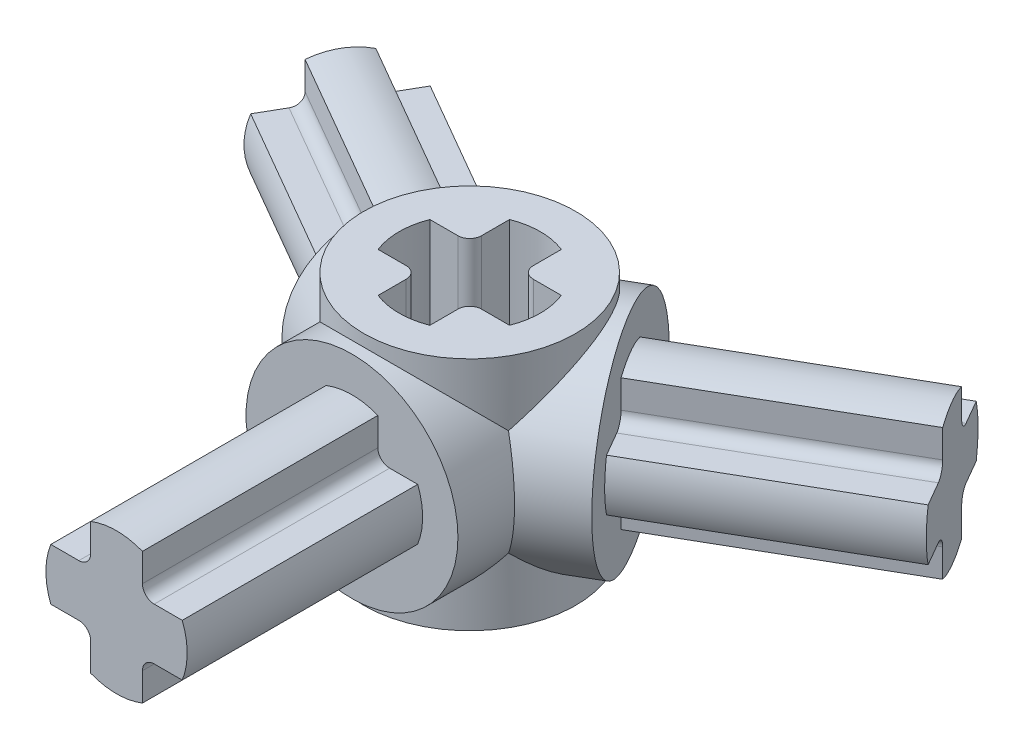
ISO-10303-21;
HEADER;
FILE_DESCRIPTION(('STEP AP214'),'2;1');
FILE_NAME('part.step','',(''),(''),'','','');
FILE_SCHEMA(('AUTOMOTIVE_DESIGN { 1 0 10303 214 1 1 1 1 }'));
ENDSEC;
DATA;
#1=APPLICATION_CONTEXT('core data for automotive mechanical design processes');
#2=APPLICATION_PROTOCOL_DEFINITION('international standard','automotive_design',2000,#1);
#3=PRODUCT_CONTEXT('',#1,'mechanical');
#4=PRODUCT('Part','Part','',(#3));
#5=PRODUCT_RELATED_PRODUCT_CATEGORY('part','',(#4));
#6=PRODUCT_DEFINITION_FORMATION('','',#4);
#7=PRODUCT_DEFINITION_CONTEXT('part definition',#1,'design');
#8=PRODUCT_DEFINITION('design','',#6,#7);
#9=PRODUCT_DEFINITION_SHAPE('','',#8);
#10=(LENGTH_UNIT() NAMED_UNIT(*) SI_UNIT(.MILLI.,.METRE.));
#11=(NAMED_UNIT(*) PLANE_ANGLE_UNIT() SI_UNIT($,.RADIAN.));
#12=(NAMED_UNIT(*) SI_UNIT($,.STERADIAN.) SOLID_ANGLE_UNIT());
#13=UNCERTAINTY_MEASURE_WITH_UNIT(LENGTH_MEASURE(1.E-05),#10,'distance_accuracy_value','');
#14=(GEOMETRIC_REPRESENTATION_CONTEXT(3) GLOBAL_UNCERTAINTY_ASSIGNED_CONTEXT((#13)) GLOBAL_UNIT_ASSIGNED_CONTEXT((#10,
#11,#12)) REPRESENTATION_CONTEXT('',''));
#15=CARTESIAN_POINT('',(0.,0.,0.));
#16=DIRECTION('',(0.,0.,1.));
#17=DIRECTION('',(1.,0.,0.));
#18=AXIS2_PLACEMENT_3D('',#15,#16,#17);
#19=CARTESIAN_POINT('',(3.46410161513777,0.,-1.99999999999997));
#20=DIRECTION('',(0.866025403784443,0.,-0.499999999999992));
#21=DIRECTION('',(-0.499999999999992,0.,-0.866025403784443));
#22=AXIS2_PLACEMENT_3D('',#19,#20,#21);
#23=PLANE('',#22);
#24=CARTESIAN_POINT('',(3.46410161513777,0.,-1.99999999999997));
#25=DIRECTION('',(0.866025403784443,0.,-0.499999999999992));
#26=DIRECTION('',(-0.499999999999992,0.,-0.866025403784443));
#27=AXIS2_PLACEMENT_3D('',#24,#25,#26);
#28=CIRCLE('',#27,3.6);
#29=CARTESIAN_POINT('',(1.6641016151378,0.,-5.11769145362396));
#30=VERTEX_POINT('',#29);
#31=EDGE_CURVE('E741',#30,#30,#28,.T.);
#32=ORIENTED_EDGE('',*,*,#31,.T.);
#33=EDGE_LOOP('',(#32));
#34=FACE_BOUND('',#33,.T.);
#35=DIRECTION('',(0.,1.,0.));
#36=VECTOR('',#35,1.);
#37=CARTESIAN_POINT('',(3.90410161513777,2.23284571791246,-1.23789764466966));
#38=LINE('',#37,#36);
#39=CARTESIAN_POINT('',(3.90410161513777,1.28,-1.23789764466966));
#40=VERTEX_POINT('',#39);
#41=CARTESIAN_POINT('',(3.90410161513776,2.23284571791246,-1.23789764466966));
#42=VERTEX_POINT('',#41);
#43=EDGE_CURVE('E1845',#40,#42,#38,.T.);
#44=ORIENTED_EDGE('',*,*,#43,.T.);
#45=CARTESIAN_POINT('',(3.46410161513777,0.,-1.99999999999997));
#46=DIRECTION('',(0.866025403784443,0.,-0.499999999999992));
#47=DIRECTION('',(-0.499999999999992,0.,-0.866025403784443));
#48=AXIS2_PLACEMENT_3D('',#45,#46,#47);
#49=CIRCLE('',#48,2.4);
#50=CARTESIAN_POINT('',(3.02410161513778,2.23284571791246,-2.76210235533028));
#51=VERTEX_POINT('',#50);
#52=EDGE_CURVE('E55',#42,#51,#49,.F.);
#53=ORIENTED_EDGE('',*,*,#52,.T.);
#54=DIRECTION('',(0.,-1.,0.));
#55=VECTOR('',#54,1.);
#56=CARTESIAN_POINT('',(3.02410161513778,1.28,-2.76210235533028));
#57=LINE('',#56,#55);
#58=CARTESIAN_POINT('',(3.02410161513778,1.28,-2.76210235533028));
#59=VERTEX_POINT('',#58);
#60=EDGE_CURVE('E467',#51,#59,#57,.T.);
#61=ORIENTED_EDGE('',*,*,#60,.T.);
#62=CARTESIAN_POINT('',(2.82410161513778,1.28,-3.10851251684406));
#63=DIRECTION('',(0.866025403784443,0.,-0.499999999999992));
#64=DIRECTION('',(-0.499999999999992,0.,-0.866025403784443));
#65=AXIS2_PLACEMENT_3D('',#62,#63,#64);
#66=CIRCLE('',#65,0.4);
#67=CARTESIAN_POINT('',(2.82410161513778,0.88,-3.10851251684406));
#68=VERTEX_POINT('',#67);
#69=EDGE_CURVE('E476',#59,#68,#66,.T.);
#70=ORIENTED_EDGE('',*,*,#69,.T.);
#71=DIRECTION('',(-0.499999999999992,0.,-0.866025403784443));
#72=VECTOR('',#71,1.);
#73=CARTESIAN_POINT('',(2.34767875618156,0.88,-3.93370111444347));
#74=LINE('',#73,#72);
#75=CARTESIAN_POINT('',(2.34767875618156,0.88,-3.93370111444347));
#76=VERTEX_POINT('',#75);
#77=EDGE_CURVE('E483',#68,#76,#74,.T.);
#78=ORIENTED_EDGE('',*,*,#77,.T.);
#79=CARTESIAN_POINT('',(3.46410161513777,0.,-1.99999999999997));
#80=DIRECTION('',(0.866025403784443,0.,-0.499999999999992));
#81=DIRECTION('',(-0.499999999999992,0.,-0.866025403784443));
#82=AXIS2_PLACEMENT_3D('',#79,#80,#81);
#83=CIRCLE('',#82,2.4);
#84=CARTESIAN_POINT('',(2.34767875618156,-0.880000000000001,-3.93370111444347));
#85=VERTEX_POINT('',#84);
#86=EDGE_CURVE('E1892',#76,#85,#83,.F.);
#87=ORIENTED_EDGE('',*,*,#86,.T.);
#88=DIRECTION('',(0.499999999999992,0.,0.866025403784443));
#89=VECTOR('',#88,1.);
#90=CARTESIAN_POINT('',(2.82410161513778,-0.880000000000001,-3.10851251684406));
#91=LINE('',#90,#89);
#92=CARTESIAN_POINT('',(2.82410161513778,-0.880000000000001,-3.10851251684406));
#93=VERTEX_POINT('',#92);
#94=EDGE_CURVE('E1888',#85,#93,#91,.T.);
#95=ORIENTED_EDGE('',*,*,#94,.T.);
#96=CARTESIAN_POINT('',(2.82410161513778,-1.28,-3.10851251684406));
#97=DIRECTION('',(0.866025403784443,0.,-0.499999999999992));
#98=DIRECTION('',(-0.499999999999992,0.,-0.866025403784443));
#99=AXIS2_PLACEMENT_3D('',#96,#97,#98);
#100=CIRCLE('',#99,0.4);
#101=CARTESIAN_POINT('',(3.02410161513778,-1.28,-2.76210235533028));
#102=VERTEX_POINT('',#101);
#103=EDGE_CURVE('E1884',#93,#102,#100,.T.);
#104=ORIENTED_EDGE('',*,*,#103,.T.);
#105=DIRECTION('',(0.,-1.,0.));
#106=VECTOR('',#105,1.);
#107=CARTESIAN_POINT('',(3.02410161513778,-2.23284571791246,-2.76210235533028));
#108=LINE('',#107,#106);
#109=CARTESIAN_POINT('',(3.02410161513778,-2.23284571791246,-2.76210235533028));
#110=VERTEX_POINT('',#109);
#111=EDGE_CURVE('E1880',#102,#110,#108,.T.);
#112=ORIENTED_EDGE('',*,*,#111,.T.);
#113=CARTESIAN_POINT('',(3.46410161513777,0.,-1.99999999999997));
#114=DIRECTION('',(0.866025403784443,0.,-0.499999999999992));
#115=DIRECTION('',(-0.499999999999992,0.,-0.866025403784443));
#116=AXIS2_PLACEMENT_3D('',#113,#114,#115);
#117=CIRCLE('',#116,2.4);
#118=CARTESIAN_POINT('',(3.90410161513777,-2.23284571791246,-1.23789764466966));
#119=VERTEX_POINT('',#118);
#120=EDGE_CURVE('E1876',#110,#119,#117,.F.);
#121=ORIENTED_EDGE('',*,*,#120,.T.);
#122=DIRECTION('',(0.,1.,0.));
#123=VECTOR('',#122,1.);
#124=CARTESIAN_POINT('',(3.90410161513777,-1.28,-1.23789764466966));
#125=LINE('',#124,#123);
#126=CARTESIAN_POINT('',(3.90410161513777,-1.28,-1.23789764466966));
#127=VERTEX_POINT('',#126);
#128=EDGE_CURVE('E1872',#119,#127,#125,.T.);
#129=ORIENTED_EDGE('',*,*,#128,.T.);
#130=CARTESIAN_POINT('',(4.10410161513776,-1.28,-0.891487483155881));
#131=DIRECTION('',(0.866025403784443,0.,-0.499999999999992));
#132=DIRECTION('',(-0.499999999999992,0.,-0.866025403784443));
#133=AXIS2_PLACEMENT_3D('',#130,#131,#132);
#134=CIRCLE('',#133,0.4);
#135=CARTESIAN_POINT('',(4.10410161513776,-0.880000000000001,-0.89148748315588));
#136=VERTEX_POINT('',#135);
#137=EDGE_CURVE('E1868',#127,#136,#134,.T.);
#138=ORIENTED_EDGE('',*,*,#137,.T.);
#139=DIRECTION('',(0.499999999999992,0.,0.866025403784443));
#140=VECTOR('',#139,1.);
#141=CARTESIAN_POINT('',(4.58052447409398,-0.880000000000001,-0.0662988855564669));
#142=LINE('',#141,#140);
#143=CARTESIAN_POINT('',(4.58052447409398,-0.880000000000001,-0.0662988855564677));
#144=VERTEX_POINT('',#143);
#145=EDGE_CURVE('E1864',#136,#144,#142,.T.);
#146=ORIENTED_EDGE('',*,*,#145,.T.);
#147=CARTESIAN_POINT('',(3.46410161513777,0.,-1.99999999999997));
#148=DIRECTION('',(0.866025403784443,0.,-0.499999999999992));
#149=DIRECTION('',(-0.499999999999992,0.,-0.866025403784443));
#150=AXIS2_PLACEMENT_3D('',#147,#148,#149);
#151=CIRCLE('',#150,2.4);
#152=CARTESIAN_POINT('',(4.58052447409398,0.88,-0.0662988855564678));
#153=VERTEX_POINT('',#152);
#154=EDGE_CURVE('E1860',#144,#153,#151,.F.);
#155=ORIENTED_EDGE('',*,*,#154,.T.);
#156=DIRECTION('',(-0.499999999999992,0.,-0.866025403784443));
#157=VECTOR('',#156,1.);
#158=CARTESIAN_POINT('',(4.10410161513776,0.88,-0.891487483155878));
#159=LINE('',#158,#157);
#160=CARTESIAN_POINT('',(4.10410161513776,0.88,-0.891487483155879));
#161=VERTEX_POINT('',#160);
#162=EDGE_CURVE('E1855',#153,#161,#159,.T.);
#163=ORIENTED_EDGE('',*,*,#162,.T.);
#164=CARTESIAN_POINT('',(4.10410161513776,1.28,-0.891487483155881));
#165=DIRECTION('',(0.866025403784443,0.,-0.499999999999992));
#166=DIRECTION('',(-0.499999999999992,0.,-0.866025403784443));
#167=AXIS2_PLACEMENT_3D('',#164,#165,#166);
#168=CIRCLE('',#167,0.4);
#169=EDGE_CURVE('E1849',#161,#40,#168,.T.);
#170=ORIENTED_EDGE('',*,*,#169,.T.);
#171=EDGE_LOOP('',(#44,#53,#61,#70,#78,#87,#95,#104,#112,#121,#129,#138,#146,#155,#163,#170));
#172=FACE_BOUND('',#171,.T.);
#173=ADVANCED_FACE('F39',(#34,#172),#23,.T.);
#174=CARTESIAN_POINT('',(-3.46410161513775,0.,-2.00000000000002));
#175=DIRECTION('',(-0.866025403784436,0.,-0.500000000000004));
#176=DIRECTION('',(-0.500000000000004,0.,0.866025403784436));
#177=AXIS2_PLACEMENT_3D('',#174,#175,#176);
#178=PLANE('',#177);
#179=CARTESIAN_POINT('',(-3.46410161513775,0.,-2.00000000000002));
#180=DIRECTION('',(-0.866025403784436,0.,-0.500000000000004));
#181=DIRECTION('',(-0.500000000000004,0.,0.866025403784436));
#182=AXIS2_PLACEMENT_3D('',#179,#180,#181);
#183=CIRCLE('',#182,3.6);
#184=CARTESIAN_POINT('',(-5.26410161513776,0.,1.11769145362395));
#185=VERTEX_POINT('',#184);
#186=EDGE_CURVE('E755',#185,#185,#183,.T.);
#187=ORIENTED_EDGE('',*,*,#186,.T.);
#188=EDGE_LOOP('',(#187));
#189=FACE_BOUND('',#188,.T.);
#190=DIRECTION('',(0.,1.,0.));
#191=VECTOR('',#190,1.);
#192=CARTESIAN_POINT('',(-3.02410161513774,2.23284571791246,-2.76210235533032));
#193=LINE('',#192,#191);
#194=CARTESIAN_POINT('',(-3.02410161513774,1.28,-2.76210235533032));
#195=VERTEX_POINT('',#194);
#196=CARTESIAN_POINT('',(-3.02410161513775,2.23284571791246,-2.76210235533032));
#197=VERTEX_POINT('',#196);
#198=EDGE_CURVE('E585',#195,#197,#193,.T.);
#199=ORIENTED_EDGE('',*,*,#198,.T.);
#200=CARTESIAN_POINT('',(-3.46410161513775,0.,-2.00000000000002));
#201=DIRECTION('',(-0.866025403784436,0.,-0.500000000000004));
#202=DIRECTION('',(-0.500000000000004,0.,0.866025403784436));
#203=AXIS2_PLACEMENT_3D('',#200,#201,#202);
#204=CIRCLE('',#203,2.4);
#205=CARTESIAN_POINT('',(-3.90410161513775,2.23284571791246,-1.23789764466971));
#206=VERTEX_POINT('',#205);
#207=EDGE_CURVE('E63',#197,#206,#204,.F.);
#208=ORIENTED_EDGE('',*,*,#207,.T.);
#209=DIRECTION('',(0.,-1.,0.));
#210=VECTOR('',#209,1.);
#211=CARTESIAN_POINT('',(-3.90410161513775,1.28,-1.23789764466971));
#212=LINE('',#211,#210);
#213=CARTESIAN_POINT('',(-3.90410161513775,1.28,-1.23789764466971));
#214=VERTEX_POINT('',#213);
#215=EDGE_CURVE('E581',#206,#214,#212,.T.);
#216=ORIENTED_EDGE('',*,*,#215,.T.);
#217=CARTESIAN_POINT('',(-4.10410161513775,1.28,-0.891487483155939));
#218=DIRECTION('',(-0.866025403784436,0.,-0.500000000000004));
#219=DIRECTION('',(-0.500000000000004,0.,0.866025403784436));
#220=AXIS2_PLACEMENT_3D('',#217,#218,#219);
#221=CIRCLE('',#220,0.4);
#222=CARTESIAN_POINT('',(-4.10410161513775,0.88,-0.891487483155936));
#223=VERTEX_POINT('',#222);
#224=EDGE_CURVE('E637',#214,#223,#221,.T.);
#225=ORIENTED_EDGE('',*,*,#224,.T.);
#226=DIRECTION('',(-0.500000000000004,0.,0.866025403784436));
#227=VECTOR('',#226,1.);
#228=CARTESIAN_POINT('',(-4.58052447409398,0.88,-0.0662988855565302));
#229=LINE('',#228,#227);
#230=CARTESIAN_POINT('',(-4.58052447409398,0.88,-0.0662988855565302));
#231=VERTEX_POINT('',#230);
#232=EDGE_CURVE('E633',#223,#231,#229,.T.);
#233=ORIENTED_EDGE('',*,*,#232,.T.);
#234=CARTESIAN_POINT('',(-3.46410161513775,0.,-2.00000000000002));
#235=DIRECTION('',(-0.866025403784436,0.,-0.500000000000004));
#236=DIRECTION('',(-0.500000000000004,0.,0.866025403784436));
#237=AXIS2_PLACEMENT_3D('',#234,#235,#236);
#238=CIRCLE('',#237,2.4);
#239=CARTESIAN_POINT('',(-4.58052447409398,-0.880000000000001,-0.066298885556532));
#240=VERTEX_POINT('',#239);
#241=EDGE_CURVE('E629',#231,#240,#238,.F.);
#242=ORIENTED_EDGE('',*,*,#241,.T.);
#243=DIRECTION('',(0.500000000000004,0.,-0.866025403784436));
#244=VECTOR('',#243,1.);
#245=CARTESIAN_POINT('',(-4.10410161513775,-0.880000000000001,-0.891487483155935));
#246=LINE('',#245,#244);
#247=CARTESIAN_POINT('',(-4.10410161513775,-0.880000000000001,-0.891487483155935));
#248=VERTEX_POINT('',#247);
#249=EDGE_CURVE('E625',#240,#248,#246,.T.);
#250=ORIENTED_EDGE('',*,*,#249,.T.);
#251=CARTESIAN_POINT('',(-4.10410161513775,-1.28,-0.891487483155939));
#252=DIRECTION('',(-0.866025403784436,0.,-0.500000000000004));
#253=DIRECTION('',(-0.500000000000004,0.,0.866025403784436));
#254=AXIS2_PLACEMENT_3D('',#251,#252,#253);
#255=CIRCLE('',#254,0.4);
#256=CARTESIAN_POINT('',(-3.90410161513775,-1.28,-1.23789764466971));
#257=VERTEX_POINT('',#256);
#258=EDGE_CURVE('E621',#248,#257,#255,.T.);
#259=ORIENTED_EDGE('',*,*,#258,.T.);
#260=DIRECTION('',(0.,-1.,0.));
#261=VECTOR('',#260,1.);
#262=CARTESIAN_POINT('',(-3.90410161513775,-2.23284571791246,-1.23789764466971));
#263=LINE('',#262,#261);
#264=CARTESIAN_POINT('',(-3.90410161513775,-2.23284571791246,-1.23789764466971));
#265=VERTEX_POINT('',#264);
#266=EDGE_CURVE('E617',#257,#265,#263,.T.);
#267=ORIENTED_EDGE('',*,*,#266,.T.);
#268=CARTESIAN_POINT('',(-3.46410161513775,0.,-2.00000000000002));
#269=DIRECTION('',(-0.866025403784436,0.,-0.500000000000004));
#270=DIRECTION('',(-0.500000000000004,0.,0.866025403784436));
#271=AXIS2_PLACEMENT_3D('',#268,#269,#270);
#272=CIRCLE('',#271,2.4);
#273=CARTESIAN_POINT('',(-3.02410161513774,-2.23284571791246,-2.76210235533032));
#274=VERTEX_POINT('',#273);
#275=EDGE_CURVE('E613',#265,#274,#272,.F.);
#276=ORIENTED_EDGE('',*,*,#275,.T.);
#277=DIRECTION('',(0.,1.,0.));
#278=VECTOR('',#277,1.);
#279=CARTESIAN_POINT('',(-3.02410161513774,-1.28,-2.76210235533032));
#280=LINE('',#279,#278);
#281=CARTESIAN_POINT('',(-3.02410161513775,-1.28,-2.76210235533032));
#282=VERTEX_POINT('',#281);
#283=EDGE_CURVE('E609',#274,#282,#280,.T.);
#284=ORIENTED_EDGE('',*,*,#283,.T.);
#285=CARTESIAN_POINT('',(-2.82410161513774,-1.28,-3.1085125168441));
#286=DIRECTION('',(-0.866025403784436,0.,-0.500000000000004));
#287=DIRECTION('',(-0.500000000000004,0.,0.866025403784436));
#288=AXIS2_PLACEMENT_3D('',#285,#286,#287);
#289=CIRCLE('',#288,0.4);
#290=CARTESIAN_POINT('',(-2.82410161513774,-0.880000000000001,-3.1085125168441));
#291=VERTEX_POINT('',#290);
#292=EDGE_CURVE('E605',#282,#291,#289,.T.);
#293=ORIENTED_EDGE('',*,*,#292,.T.);
#294=DIRECTION('',(0.500000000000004,0.,-0.866025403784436));
#295=VECTOR('',#294,1.);
#296=CARTESIAN_POINT('',(-2.34767875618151,-0.880000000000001,-3.9337011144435));
#297=LINE('',#296,#295);
#298=CARTESIAN_POINT('',(-2.34767875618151,-0.880000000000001,-3.9337011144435));
#299=VERTEX_POINT('',#298);
#300=EDGE_CURVE('E601',#291,#299,#297,.T.);
#301=ORIENTED_EDGE('',*,*,#300,.T.);
#302=CARTESIAN_POINT('',(-3.46410161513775,0.,-2.00000000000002));
#303=DIRECTION('',(-0.866025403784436,0.,-0.500000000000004));
#304=DIRECTION('',(-0.500000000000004,0.,0.866025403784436));
#305=AXIS2_PLACEMENT_3D('',#302,#303,#304);
#306=CIRCLE('',#305,2.4);
#307=CARTESIAN_POINT('',(-2.34767875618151,0.88,-3.9337011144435));
#308=VERTEX_POINT('',#307);
#309=EDGE_CURVE('E597',#299,#308,#306,.F.);
#310=ORIENTED_EDGE('',*,*,#309,.T.);
#311=DIRECTION('',(-0.500000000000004,0.,0.866025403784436));
#312=VECTOR('',#311,1.);
#313=CARTESIAN_POINT('',(-2.82410161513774,0.88,-3.1085125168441));
#314=LINE('',#313,#312);
#315=CARTESIAN_POINT('',(-2.82410161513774,0.88,-3.1085125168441));
#316=VERTEX_POINT('',#315);
#317=EDGE_CURVE('E593',#308,#316,#314,.T.);
#318=ORIENTED_EDGE('',*,*,#317,.T.);
#319=CARTESIAN_POINT('',(-2.82410161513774,1.28,-3.1085125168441));
#320=DIRECTION('',(-0.866025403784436,0.,-0.500000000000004));
#321=DIRECTION('',(-0.500000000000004,0.,0.866025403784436));
#322=AXIS2_PLACEMENT_3D('',#319,#320,#321);
#323=CIRCLE('',#322,0.4);
#324=EDGE_CURVE('E589',#316,#195,#323,.T.);
#325=ORIENTED_EDGE('',*,*,#324,.T.);
#326=EDGE_LOOP('',(#199,#208,#216,#225,#233,#242,#250,#259,#267,#276,#284,#293,#301,#310,#318,#325));
#327=FACE_BOUND('',#326,.T.);
#328=ADVANCED_FACE('F1200',(#189,#327),#178,.T.);
#329=CARTESIAN_POINT('',(0.,-4.,0.));
#330=DIRECTION('',(0.,1.,0.));
#331=DIRECTION('',(0.,0.,1.));
#332=AXIS2_PLACEMENT_3D('',#329,#330,#331);
#333=CYLINDRICAL_SURFACE('',#332,3.6);
#334=CARTESIAN_POINT('',(0.,0.,0.));
#335=DIRECTION('',(-0.612372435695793,0.707106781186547,-0.353553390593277));
#336=DIRECTION('',(-0.612372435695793,-0.707106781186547,-0.353553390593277));
#337=AXIS2_PLACEMENT_3D('',#334,#335,#336);
#338=ELLIPSE('',#337,5.09116882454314,3.6);
#339=CARTESIAN_POINT('',(-3.11769145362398,-1.79999999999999,1.79999999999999));
#340=VERTEX_POINT('',#339);
#341=CARTESIAN_POINT('',(0.,-1.79999999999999,-3.6));
#342=VERTEX_POINT('',#341);
#343=EDGE_CURVE('E760',#340,#342,#338,.F.);
#344=ORIENTED_EDGE('',*,*,#343,.T.);
#345=CARTESIAN_POINT('',(0.,0.,0.));
#346=DIRECTION('',(0.612372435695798,0.707106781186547,-0.353553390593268));
#347=DIRECTION('',(0.612372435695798,-0.707106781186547,-0.353553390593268));
#348=AXIS2_PLACEMENT_3D('',#345,#346,#347);
#349=ELLIPSE('',#348,5.09116882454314,3.6);
#350=CARTESIAN_POINT('',(3.11769145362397,-1.80000000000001,1.80000000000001));
#351=VERTEX_POINT('',#350);
#352=EDGE_CURVE('E740',#342,#351,#349,.F.);
#353=ORIENTED_EDGE('',*,*,#352,.T.);
#354=CARTESIAN_POINT('',(0.,0.,0.));
#355=DIRECTION('',(0.,0.707106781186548,0.707106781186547));
#356=DIRECTION('',(0.,-0.707106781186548,0.707106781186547));
#357=AXIS2_PLACEMENT_3D('',#354,#355,#356);
#358=ELLIPSE('',#357,5.09116882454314,3.6);
#359=EDGE_CURVE('E939',#351,#340,#358,.F.);
#360=ORIENTED_EDGE('',*,*,#359,.T.);
#361=EDGE_LOOP('',(#344,#353,#360));
#362=FACE_BOUND('',#361,.T.);
#363=CARTESIAN_POINT('',(0.,-4.,0.));
#364=DIRECTION('',(0.,1.,0.));
#365=DIRECTION('',(0.,0.,1.));
#366=AXIS2_PLACEMENT_3D('',#363,#364,#365);
#367=CIRCLE('',#366,3.6);
#368=CARTESIAN_POINT('',(0.,-4.,3.6));
#369=VERTEX_POINT('',#368);
#370=EDGE_CURVE('E11',#369,#369,#367,.T.);
#371=ORIENTED_EDGE('',*,*,#370,.T.);
#372=EDGE_LOOP('',(#371));
#373=FACE_BOUND('',#372,.T.);
#374=ADVANCED_FACE('F1206',(#362,#373),#333,.T.);
#375=CARTESIAN_POINT('',(0.,0.,4.));
#376=DIRECTION('',(0.,0.,1.));
#377=DIRECTION('',(1.,0.,0.));
#378=AXIS2_PLACEMENT_3D('',#375,#376,#377);
#379=PLANE('',#378);
#380=CARTESIAN_POINT('',(0.,0.,4.));
#381=DIRECTION('',(0.,0.,1.));
#382=DIRECTION('',(1.,0.,0.));
#383=AXIS2_PLACEMENT_3D('',#380,#381,#382);
#384=CIRCLE('',#383,3.6);
#385=CARTESIAN_POINT('',(3.6,0.,4.));
#386=VERTEX_POINT('',#385);
#387=EDGE_CURVE('E934',#386,#386,#384,.T.);
#388=ORIENTED_EDGE('',*,*,#387,.T.);
#389=EDGE_LOOP('',(#388));
#390=FACE_BOUND('',#389,.T.);
#391=DIRECTION('',(0.,1.,0.));
#392=VECTOR('',#391,1.);
#393=CARTESIAN_POINT('',(-0.88,2.23284571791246,4.));
#394=LINE('',#393,#392);
#395=CARTESIAN_POINT('',(-0.88,1.28,4.));
#396=VERTEX_POINT('',#395);
#397=CARTESIAN_POINT('',(-0.88,2.23284571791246,4.));
#398=VERTEX_POINT('',#397);
#399=EDGE_CURVE('E777',#396,#398,#394,.T.);
#400=ORIENTED_EDGE('',*,*,#399,.T.);
#401=CARTESIAN_POINT('',(0.,0.,4.));
#402=DIRECTION('',(0.,0.,1.));
#403=DIRECTION('',(1.,0.,0.));
#404=AXIS2_PLACEMENT_3D('',#401,#402,#403);
#405=CIRCLE('',#404,2.4);
#406=CARTESIAN_POINT('',(0.880000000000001,2.23284571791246,4.));
#407=VERTEX_POINT('',#406);
#408=EDGE_CURVE('E772',#398,#407,#405,.F.);
#409=ORIENTED_EDGE('',*,*,#408,.T.);
#410=DIRECTION('',(0.,-1.,0.));
#411=VECTOR('',#410,1.);
#412=CARTESIAN_POINT('',(0.880000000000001,1.28,4.));
#413=LINE('',#412,#411);
#414=CARTESIAN_POINT('',(0.880000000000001,1.28,4.));
#415=VERTEX_POINT('',#414);
#416=EDGE_CURVE('E771',#407,#415,#413,.T.);
#417=ORIENTED_EDGE('',*,*,#416,.T.);
#418=CARTESIAN_POINT('',(1.28,1.28,4.));
#419=DIRECTION('',(0.,0.,1.));
#420=DIRECTION('',(1.,0.,0.));
#421=AXIS2_PLACEMENT_3D('',#418,#419,#420);
#422=CIRCLE('',#421,0.4);
#423=CARTESIAN_POINT('',(1.28,0.88,4.));
#424=VERTEX_POINT('',#423);
#425=EDGE_CURVE('E829',#415,#424,#422,.T.);
#426=ORIENTED_EDGE('',*,*,#425,.T.);
#427=DIRECTION('',(1.,0.,0.));
#428=VECTOR('',#427,1.);
#429=CARTESIAN_POINT('',(2.23284571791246,0.88,4.));
#430=LINE('',#429,#428);
#431=CARTESIAN_POINT('',(2.23284571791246,0.88,4.));
#432=VERTEX_POINT('',#431);
#433=EDGE_CURVE('E825',#424,#432,#430,.T.);
#434=ORIENTED_EDGE('',*,*,#433,.T.);
#435=CARTESIAN_POINT('',(0.,0.,4.));
#436=DIRECTION('',(0.,0.,1.));
#437=DIRECTION('',(1.,0.,0.));
#438=AXIS2_PLACEMENT_3D('',#435,#436,#437);
#439=CIRCLE('',#438,2.4);
#440=CARTESIAN_POINT('',(2.23284571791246,-0.880000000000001,4.));
#441=VERTEX_POINT('',#440);
#442=EDGE_CURVE('E821',#432,#441,#439,.F.);
#443=ORIENTED_EDGE('',*,*,#442,.T.);
#444=DIRECTION('',(-1.,0.,0.));
#445=VECTOR('',#444,1.);
#446=CARTESIAN_POINT('',(1.28,-0.880000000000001,4.));
#447=LINE('',#446,#445);
#448=CARTESIAN_POINT('',(1.28,-0.880000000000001,4.));
#449=VERTEX_POINT('',#448);
#450=EDGE_CURVE('E817',#441,#449,#447,.T.);
#451=ORIENTED_EDGE('',*,*,#450,.T.);
#452=CARTESIAN_POINT('',(1.28,-1.28,4.));
#453=DIRECTION('',(0.,0.,1.));
#454=DIRECTION('',(1.,0.,0.));
#455=AXIS2_PLACEMENT_3D('',#452,#453,#454);
#456=CIRCLE('',#455,0.4);
#457=CARTESIAN_POINT('',(0.880000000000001,-1.28,4.));
#458=VERTEX_POINT('',#457);
#459=EDGE_CURVE('E813',#449,#458,#456,.T.);
#460=ORIENTED_EDGE('',*,*,#459,.T.);
#461=DIRECTION('',(0.,-1.,0.));
#462=VECTOR('',#461,1.);
#463=CARTESIAN_POINT('',(0.880000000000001,-2.23284571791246,4.));
#464=LINE('',#463,#462);
#465=CARTESIAN_POINT('',(0.880000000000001,-2.23284571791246,4.));
#466=VERTEX_POINT('',#465);
#467=EDGE_CURVE('E809',#458,#466,#464,.T.);
#468=ORIENTED_EDGE('',*,*,#467,.T.);
#469=CARTESIAN_POINT('',(0.,0.,4.));
#470=DIRECTION('',(0.,0.,1.));
#471=DIRECTION('',(1.,0.,0.));
#472=AXIS2_PLACEMENT_3D('',#469,#470,#471);
#473=CIRCLE('',#472,2.4);
#474=CARTESIAN_POINT('',(-0.88,-2.23284571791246,4.));
#475=VERTEX_POINT('',#474);
#476=EDGE_CURVE('E805',#466,#475,#473,.F.);
#477=ORIENTED_EDGE('',*,*,#476,.T.);
#478=DIRECTION('',(0.,1.,0.));
#479=VECTOR('',#478,1.);
#480=CARTESIAN_POINT('',(-0.88,-1.28,4.));
#481=LINE('',#480,#479);
#482=CARTESIAN_POINT('',(-0.88,-1.28,4.));
#483=VERTEX_POINT('',#482);
#484=EDGE_CURVE('E801',#475,#483,#481,.T.);
#485=ORIENTED_EDGE('',*,*,#484,.T.);
#486=CARTESIAN_POINT('',(-1.28,-1.28,4.));
#487=DIRECTION('',(0.,0.,1.));
#488=DIRECTION('',(1.,0.,0.));
#489=AXIS2_PLACEMENT_3D('',#486,#487,#488);
#490=CIRCLE('',#489,0.4);
#491=CARTESIAN_POINT('',(-1.28,-0.880000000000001,4.));
#492=VERTEX_POINT('',#491);
#493=EDGE_CURVE('E797',#483,#492,#490,.T.);
#494=ORIENTED_EDGE('',*,*,#493,.T.);
#495=DIRECTION('',(-1.,0.,0.));
#496=VECTOR('',#495,1.);
#497=CARTESIAN_POINT('',(-2.23284571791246,-0.880000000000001,4.));
#498=LINE('',#497,#496);
#499=CARTESIAN_POINT('',(-2.23284571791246,-0.880000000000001,4.));
#500=VERTEX_POINT('',#499);
#501=EDGE_CURVE('E793',#492,#500,#498,.T.);
#502=ORIENTED_EDGE('',*,*,#501,.T.);
#503=CARTESIAN_POINT('',(0.,0.,4.));
#504=DIRECTION('',(0.,0.,1.));
#505=DIRECTION('',(1.,0.,0.));
#506=AXIS2_PLACEMENT_3D('',#503,#504,#505);
#507=CIRCLE('',#506,2.4);
#508=CARTESIAN_POINT('',(-2.23284571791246,0.88,4.));
#509=VERTEX_POINT('',#508);
#510=EDGE_CURVE('E789',#500,#509,#507,.F.);
#511=ORIENTED_EDGE('',*,*,#510,.T.);
#512=DIRECTION('',(1.,0.,0.));
#513=VECTOR('',#512,1.);
#514=CARTESIAN_POINT('',(-1.28,0.88,4.));
#515=LINE('',#514,#513);
#516=CARTESIAN_POINT('',(-1.28,0.88,4.));
#517=VERTEX_POINT('',#516);
#518=EDGE_CURVE('E785',#509,#517,#515,.T.);
#519=ORIENTED_EDGE('',*,*,#518,.T.);
#520=CARTESIAN_POINT('',(-1.28,1.28,4.));
#521=DIRECTION('',(0.,0.,1.));
#522=DIRECTION('',(1.,0.,0.));
#523=AXIS2_PLACEMENT_3D('',#520,#521,#522);
#524=CIRCLE('',#523,0.4);
#525=EDGE_CURVE('E781',#517,#396,#524,.T.);
#526=ORIENTED_EDGE('',*,*,#525,.T.);
#527=EDGE_LOOP('',(#400,#409,#417,#426,#434,#443,#451,#460,#468,#477,#485,#494,#502,#511,#519,#526));
#528=FACE_BOUND('',#527,.T.);
#529=ADVANCED_FACE('F1290',(#390,#528),#379,.T.);
#530=CARTESIAN_POINT('',(0.,0.,0.));
#531=DIRECTION('',(-0.612372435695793,-0.707106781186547,-0.353553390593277));
#532=DIRECTION('',(-0.612372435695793,0.707106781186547,-0.353553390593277));
#533=AXIS2_PLACEMENT_3D('',#530,#531,#532);
#534=ELLIPSE('',#533,5.09116882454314,3.6);
#535=CARTESIAN_POINT('',(0.,1.79999999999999,-3.6));
#536=VERTEX_POINT('',#535);
#537=CARTESIAN_POINT('',(-3.11769145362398,1.79999999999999,1.79999999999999));
#538=VERTEX_POINT('',#537);
#539=EDGE_CURVE('E763',#536,#538,#534,.F.);
#540=ORIENTED_EDGE('',*,*,#539,.T.);
#541=CARTESIAN_POINT('',(0.,0.,0.));
#542=DIRECTION('',(0.,-0.707106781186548,0.707106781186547));
#543=DIRECTION('',(0.,0.707106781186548,0.707106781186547));
#544=AXIS2_PLACEMENT_3D('',#541,#542,#543);
#545=ELLIPSE('',#544,5.09116882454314,3.6);
#546=CARTESIAN_POINT('',(3.11769145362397,1.80000000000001,1.80000000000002));
#547=VERTEX_POINT('',#546);
#548=EDGE_CURVE('E933',#538,#547,#545,.F.);
#549=ORIENTED_EDGE('',*,*,#548,.T.);
#550=CARTESIAN_POINT('',(0.,0.,0.));
#551=DIRECTION('',(0.612372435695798,-0.707106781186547,-0.353553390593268));
#552=DIRECTION('',(0.612372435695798,0.707106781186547,-0.353553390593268));
#553=AXIS2_PLACEMENT_3D('',#550,#551,#552);
#554=ELLIPSE('',#553,5.09116882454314,3.6);
#555=EDGE_CURVE('E746',#547,#536,#554,.F.);
#556=ORIENTED_EDGE('',*,*,#555,.T.);
#557=EDGE_LOOP('',(#540,#549,#556));
#558=FACE_BOUND('',#557,.T.);
#559=CARTESIAN_POINT('',(0.,4.,0.));
#560=DIRECTION('',(0.,1.,0.));
#561=DIRECTION('',(0.,0.,1.));
#562=AXIS2_PLACEMENT_3D('',#559,#560,#561);
#563=CIRCLE('',#562,3.6);
#564=CARTESIAN_POINT('',(0.,4.,3.6));
#565=VERTEX_POINT('',#564);
#566=EDGE_CURVE('E1009',#565,#565,#563,.T.);
#567=ORIENTED_EDGE('',*,*,#566,.F.);
#568=EDGE_LOOP('',(#567));
#569=FACE_BOUND('',#568,.T.);
#570=ADVANCED_FACE('F41',(#558,#569),#333,.T.);
#571=CARTESIAN_POINT('',(0.,-4.,0.));
#572=DIRECTION('',(0.,1.,0.));
#573=DIRECTION('',(0.,0.,1.));
#574=AXIS2_PLACEMENT_3D('',#571,#572,#573);
#575=PLANE('',#574);
#576=DIRECTION('',(0.,0.,-1.));
#577=VECTOR('',#576,1.);
#578=CARTESIAN_POINT('',(0.880000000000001,-4.,-1.28));
#579=LINE('',#578,#577);
#580=CARTESIAN_POINT('',(0.880000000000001,-4.,-1.28));
#581=VERTEX_POINT('',#580);
#582=CARTESIAN_POINT('',(0.88,-4.,-2.23284571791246));
#583=VERTEX_POINT('',#582);
#584=EDGE_CURVE('E1073',#581,#583,#579,.T.);
#585=ORIENTED_EDGE('',*,*,#584,.T.);
#586=CARTESIAN_POINT('',(0.,-4.,0.));
#587=DIRECTION('',(0.,1.,0.));
#588=DIRECTION('',(0.,0.,1.));
#589=AXIS2_PLACEMENT_3D('',#586,#587,#588);
#590=CIRCLE('',#589,2.4);
#591=CARTESIAN_POINT('',(-0.88,-4.,-2.23284571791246));
#592=VERTEX_POINT('',#591);
#593=EDGE_CURVE('E1013',#583,#592,#590,.T.);
#594=ORIENTED_EDGE('',*,*,#593,.T.);
#595=DIRECTION('',(0.,0.,1.));
#596=VECTOR('',#595,1.);
#597=CARTESIAN_POINT('',(-0.88,-4.,-2.23284571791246));
#598=LINE('',#597,#596);
#599=CARTESIAN_POINT('',(-0.88,-4.,-1.28));
#600=VERTEX_POINT('',#599);
#601=EDGE_CURVE('E1017',#592,#600,#598,.T.);
#602=ORIENTED_EDGE('',*,*,#601,.T.);
#603=CARTESIAN_POINT('',(-1.28,-4.,-1.28));
#604=DIRECTION('',(0.,-1.,0.));
#605=DIRECTION('',(0.,0.,1.));
#606=AXIS2_PLACEMENT_3D('',#603,#604,#605);
#607=CIRCLE('',#606,0.4);
#608=CARTESIAN_POINT('',(-1.28,-4.,-0.88));
#609=VERTEX_POINT('',#608);
#610=EDGE_CURVE('E1021',#600,#609,#607,.T.);
#611=ORIENTED_EDGE('',*,*,#610,.T.);
#612=DIRECTION('',(-1.,0.,0.));
#613=VECTOR('',#612,1.);
#614=CARTESIAN_POINT('',(-1.28,-4.,-0.88));
#615=LINE('',#614,#613);
#616=CARTESIAN_POINT('',(-2.23284571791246,-4.,-0.88));
#617=VERTEX_POINT('',#616);
#618=EDGE_CURVE('E1025',#609,#617,#615,.T.);
#619=ORIENTED_EDGE('',*,*,#618,.T.);
#620=CARTESIAN_POINT('',(0.,-4.,0.));
#621=DIRECTION('',(0.,1.,0.));
#622=DIRECTION('',(0.,0.,1.));
#623=AXIS2_PLACEMENT_3D('',#620,#621,#622);
#624=CIRCLE('',#623,2.4);
#625=CARTESIAN_POINT('',(-2.23284571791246,-4.,0.88));
#626=VERTEX_POINT('',#625);
#627=EDGE_CURVE('E1029',#617,#626,#624,.T.);
#628=ORIENTED_EDGE('',*,*,#627,.T.);
#629=DIRECTION('',(1.,0.,0.));
#630=VECTOR('',#629,1.);
#631=CARTESIAN_POINT('',(-2.23284571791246,-4.,0.88));
#632=LINE('',#631,#630);
#633=CARTESIAN_POINT('',(-1.28,-4.,0.88));
#634=VERTEX_POINT('',#633);
#635=EDGE_CURVE('E1033',#626,#634,#632,.T.);
#636=ORIENTED_EDGE('',*,*,#635,.T.);
#637=CARTESIAN_POINT('',(-1.28,-4.,1.28));
#638=DIRECTION('',(0.,-1.,0.));
#639=DIRECTION('',(0.,0.,1.));
#640=AXIS2_PLACEMENT_3D('',#637,#638,#639);
#641=CIRCLE('',#640,0.4);
#642=CARTESIAN_POINT('',(-0.88,-4.,1.28));
#643=VERTEX_POINT('',#642);
#644=EDGE_CURVE('E1037',#634,#643,#641,.T.);
#645=ORIENTED_EDGE('',*,*,#644,.T.);
#646=DIRECTION('',(0.,0.,1.));
#647=VECTOR('',#646,1.);
#648=CARTESIAN_POINT('',(-0.88,-4.,1.28));
#649=LINE('',#648,#647);
#650=CARTESIAN_POINT('',(-0.880000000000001,-4.,2.23284571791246));
#651=VERTEX_POINT('',#650);
#652=EDGE_CURVE('E1041',#643,#651,#649,.T.);
#653=ORIENTED_EDGE('',*,*,#652,.T.);
#654=CARTESIAN_POINT('',(0.,-4.,0.));
#655=DIRECTION('',(0.,1.,0.));
#656=DIRECTION('',(0.,0.,1.));
#657=AXIS2_PLACEMENT_3D('',#654,#655,#656);
#658=CIRCLE('',#657,2.4);
#659=CARTESIAN_POINT('',(0.88,-4.,2.23284571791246));
#660=VERTEX_POINT('',#659);
#661=EDGE_CURVE('E1045',#651,#660,#658,.T.);
#662=ORIENTED_EDGE('',*,*,#661,.T.);
#663=DIRECTION('',(0.,0.,-1.));
#664=VECTOR('',#663,1.);
#665=CARTESIAN_POINT('',(0.88,-4.,2.23284571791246));
#666=LINE('',#665,#664);
#667=CARTESIAN_POINT('',(0.880000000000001,-4.,1.28));
#668=VERTEX_POINT('',#667);
#669=EDGE_CURVE('E1049',#660,#668,#666,.T.);
#670=ORIENTED_EDGE('',*,*,#669,.T.);
#671=CARTESIAN_POINT('',(1.28,-4.,1.28));
#672=DIRECTION('',(0.,-1.,0.));
#673=DIRECTION('',(0.,0.,-1.));
#674=AXIS2_PLACEMENT_3D('',#671,#672,#673);
#675=CIRCLE('',#674,0.4);
#676=CARTESIAN_POINT('',(1.28,-4.,0.88));
#677=VERTEX_POINT('',#676);
#678=EDGE_CURVE('E1053',#668,#677,#675,.T.);
#679=ORIENTED_EDGE('',*,*,#678,.T.);
#680=DIRECTION('',(1.,0.,0.));
#681=VECTOR('',#680,1.);
#682=CARTESIAN_POINT('',(1.28,-4.,0.88));
#683=LINE('',#682,#681);
#684=CARTESIAN_POINT('',(2.23284571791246,-4.,0.880000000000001));
#685=VERTEX_POINT('',#684);
#686=EDGE_CURVE('E1057',#677,#685,#683,.T.);
#687=ORIENTED_EDGE('',*,*,#686,.T.);
#688=CARTESIAN_POINT('',(0.,-4.,0.));
#689=DIRECTION('',(0.,1.,0.));
#690=DIRECTION('',(0.,0.,1.));
#691=AXIS2_PLACEMENT_3D('',#688,#689,#690);
#692=CIRCLE('',#691,2.4);
#693=CARTESIAN_POINT('',(2.23284571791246,-4.,-0.88));
#694=VERTEX_POINT('',#693);
#695=EDGE_CURVE('E1061',#685,#694,#692,.T.);
#696=ORIENTED_EDGE('',*,*,#695,.T.);
#697=DIRECTION('',(-1.,0.,0.));
#698=VECTOR('',#697,1.);
#699=CARTESIAN_POINT('',(2.23284571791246,-4.,-0.88));
#700=LINE('',#699,#698);
#701=CARTESIAN_POINT('',(1.28,-4.,-0.88));
#702=VERTEX_POINT('',#701);
#703=EDGE_CURVE('E1065',#694,#702,#700,.T.);
#704=ORIENTED_EDGE('',*,*,#703,.T.);
#705=CARTESIAN_POINT('',(1.28,-4.,-1.28));
#706=DIRECTION('',(0.,-1.,0.));
#707=DIRECTION('',(0.,0.,-1.));
#708=AXIS2_PLACEMENT_3D('',#705,#706,#707);
#709=CIRCLE('',#708,0.4);
#710=EDGE_CURVE('E1069',#702,#581,#709,.T.);
#711=ORIENTED_EDGE('',*,*,#710,.T.);
#712=EDGE_LOOP('',(#585,#594,#602,#611,#619,#628,#636,#645,#653,#662,#670,#679,#687,#696,#704,#711));
#713=FACE_BOUND('',#712,.T.);
#714=ORIENTED_EDGE('',*,*,#370,.F.);
#715=EDGE_LOOP('',(#714));
#716=FACE_BOUND('',#715,.T.);
#717=ADVANCED_FACE('F1141',(#713,#716),#575,.F.);
#718=CARTESIAN_POINT('',(0.,-4.,0.));
#719=DIRECTION('',(0.,1.,0.));
#720=DIRECTION('',(0.,0.,1.));
#721=AXIS2_PLACEMENT_3D('',#718,#719,#720);
#722=CYLINDRICAL_SURFACE('',#721,2.4);
#723=DIRECTION('',(0.,1.,0.));
#724=VECTOR('',#723,1.);
#725=CARTESIAN_POINT('',(0.88,-4.,-2.23284571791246));
#726=LINE('',#725,#724);
#727=CARTESIAN_POINT('',(0.88,4.,-2.23284571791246));
#728=VERTEX_POINT('',#727);
#729=EDGE_CURVE('E48',#583,#728,#726,.T.);
#730=ORIENTED_EDGE('',*,*,#729,.T.);
#731=CARTESIAN_POINT('',(0.,4.,0.));
#732=DIRECTION('',(0.,1.,0.));
#733=DIRECTION('',(0.,0.,1.));
#734=AXIS2_PLACEMENT_3D('',#731,#732,#733);
#735=CIRCLE('',#734,2.4);
#736=CARTESIAN_POINT('',(-0.88,4.,-2.23284571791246));
#737=VERTEX_POINT('',#736);
#738=EDGE_CURVE('E938',#728,#737,#735,.T.);
#739=ORIENTED_EDGE('',*,*,#738,.T.);
#740=DIRECTION('',(0.,1.,0.));
#741=VECTOR('',#740,1.);
#742=CARTESIAN_POINT('',(-0.88,-4.,-2.23284571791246));
#743=LINE('',#742,#741);
#744=EDGE_CURVE('E1077',#592,#737,#743,.T.);
#745=ORIENTED_EDGE('',*,*,#744,.F.);
#746=ORIENTED_EDGE('',*,*,#593,.F.);
#747=EDGE_LOOP('',(#730,#739,#745,#746));
#748=FACE_BOUND('',#747,.T.);
#749=ADVANCED_FACE('F1131',(#748),#722,.F.);
#750=CARTESIAN_POINT('',(0.880000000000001,-4.,-1.28));
#751=DIRECTION('',(1.,0.,0.));
#752=DIRECTION('',(0.,0.,-1.));
#753=AXIS2_PLACEMENT_3D('',#750,#751,#752);
#754=PLANE('',#753);
#755=DIRECTION('',(0.,1.,0.));
#756=VECTOR('',#755,1.);
#757=CARTESIAN_POINT('',(0.880000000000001,-4.,-1.28));
#758=LINE('',#757,#756);
#759=CARTESIAN_POINT('',(0.880000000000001,4.,-1.28));
#760=VERTEX_POINT('',#759);
#761=EDGE_CURVE('E1080',#581,#760,#758,.T.);
#762=ORIENTED_EDGE('',*,*,#761,.T.);
#763=DIRECTION('',(0.,0.,-1.));
#764=VECTOR('',#763,1.);
#765=CARTESIAN_POINT('',(0.880000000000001,4.,-1.28));
#766=LINE('',#765,#764);
#767=EDGE_CURVE('E1005',#760,#728,#766,.T.);
#768=ORIENTED_EDGE('',*,*,#767,.T.);
#769=ORIENTED_EDGE('',*,*,#729,.F.);
#770=ORIENTED_EDGE('',*,*,#584,.F.);
#771=EDGE_LOOP('',(#762,#768,#769,#770));
#772=FACE_BOUND('',#771,.T.);
#773=ADVANCED_FACE('F1146',(#772),#754,.F.);
#774=CARTESIAN_POINT('',(1.28,-4.,-1.28));
#775=DIRECTION('',(0.,1.,0.));
#776=DIRECTION('',(0.,0.,1.));
#777=AXIS2_PLACEMENT_3D('',#774,#775,#776);
#778=CYLINDRICAL_SURFACE('',#777,0.4);
#779=DIRECTION('',(0.,1.,0.));
#780=VECTOR('',#779,1.);
#781=CARTESIAN_POINT('',(1.28,-4.,-0.88));
#782=LINE('',#781,#780);
#783=CARTESIAN_POINT('',(1.28,4.,-0.88));
#784=VERTEX_POINT('',#783);
#785=EDGE_CURVE('E1083',#702,#784,#782,.T.);
#786=ORIENTED_EDGE('',*,*,#785,.T.);
#787=CARTESIAN_POINT('',(1.28,4.,-1.28));
#788=DIRECTION('',(0.,-1.,0.));
#789=DIRECTION('',(0.,0.,-1.));
#790=AXIS2_PLACEMENT_3D('',#787,#788,#789);
#791=CIRCLE('',#790,0.4);
#792=EDGE_CURVE('E1001',#784,#760,#791,.T.);
#793=ORIENTED_EDGE('',*,*,#792,.T.);
#794=ORIENTED_EDGE('',*,*,#761,.F.);
#795=ORIENTED_EDGE('',*,*,#710,.F.);
#796=EDGE_LOOP('',(#786,#793,#794,#795));
#797=FACE_BOUND('',#796,.T.);
#798=ADVANCED_FACE('F1151',(#797),#778,.T.);
#799=CARTESIAN_POINT('',(2.23284571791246,-4.,-0.88));
#800=DIRECTION('',(0.,0.,-1.));
#801=DIRECTION('',(-1.,0.,0.));
#802=AXIS2_PLACEMENT_3D('',#799,#800,#801);
#803=PLANE('',#802);
#804=DIRECTION('',(0.,1.,0.));
#805=VECTOR('',#804,1.);
#806=CARTESIAN_POINT('',(2.23284571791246,-4.,-0.88));
#807=LINE('',#806,#805);
#808=CARTESIAN_POINT('',(2.23284571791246,4.,-0.88));
#809=VERTEX_POINT('',#808);
#810=EDGE_CURVE('E1086',#694,#809,#807,.T.);
#811=ORIENTED_EDGE('',*,*,#810,.T.);
#812=DIRECTION('',(-1.,0.,0.));
#813=VECTOR('',#812,1.);
#814=CARTESIAN_POINT('',(2.23284571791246,4.,-0.88));
#815=LINE('',#814,#813);
#816=EDGE_CURVE('E997',#809,#784,#815,.T.);
#817=ORIENTED_EDGE('',*,*,#816,.T.);
#818=ORIENTED_EDGE('',*,*,#785,.F.);
#819=ORIENTED_EDGE('',*,*,#703,.F.);
#820=EDGE_LOOP('',(#811,#817,#818,#819));
#821=FACE_BOUND('',#820,.T.);
#822=ADVANCED_FACE('F1154',(#821),#803,.F.);
#823=CARTESIAN_POINT('',(0.,-4.,0.));
#824=DIRECTION('',(0.,1.,0.));
#825=DIRECTION('',(0.,0.,1.));
#826=AXIS2_PLACEMENT_3D('',#823,#824,#825);
#827=CYLINDRICAL_SURFACE('',#826,2.4);
#828=DIRECTION('',(0.,1.,0.));
#829=VECTOR('',#828,1.);
#830=CARTESIAN_POINT('',(2.23284571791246,-4.,0.880000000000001));
#831=LINE('',#830,#829);
#832=CARTESIAN_POINT('',(2.23284571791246,4.,0.880000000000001));
#833=VERTEX_POINT('',#832);
#834=EDGE_CURVE('E1089',#685,#833,#831,.T.);
#835=ORIENTED_EDGE('',*,*,#834,.T.);
#836=CARTESIAN_POINT('',(0.,4.,0.));
#837=DIRECTION('',(0.,1.,0.));
#838=DIRECTION('',(0.,0.,1.));
#839=AXIS2_PLACEMENT_3D('',#836,#837,#838);
#840=CIRCLE('',#839,2.4);
#841=EDGE_CURVE('E993',#833,#809,#840,.T.);
#842=ORIENTED_EDGE('',*,*,#841,.T.);
#843=ORIENTED_EDGE('',*,*,#810,.F.);
#844=ORIENTED_EDGE('',*,*,#695,.F.);
#845=EDGE_LOOP('',(#835,#842,#843,#844));
#846=FACE_BOUND('',#845,.T.);
#847=ADVANCED_FACE('F1157',(#846),#827,.F.);
#848=CARTESIAN_POINT('',(1.28,-4.,0.88));
#849=DIRECTION('',(0.,0.,1.));
#850=DIRECTION('',(1.,0.,0.));
#851=AXIS2_PLACEMENT_3D('',#848,#849,#850);
#852=PLANE('',#851);
#853=DIRECTION('',(0.,1.,0.));
#854=VECTOR('',#853,1.);
#855=CARTESIAN_POINT('',(1.28,-4.,0.88));
#856=LINE('',#855,#854);
#857=CARTESIAN_POINT('',(1.28,4.,0.88));
#858=VERTEX_POINT('',#857);
#859=EDGE_CURVE('E1092',#677,#858,#856,.T.);
#860=ORIENTED_EDGE('',*,*,#859,.T.);
#861=DIRECTION('',(1.,0.,0.));
#862=VECTOR('',#861,1.);
#863=CARTESIAN_POINT('',(1.28,4.,0.88));
#864=LINE('',#863,#862);
#865=EDGE_CURVE('E989',#858,#833,#864,.T.);
#866=ORIENTED_EDGE('',*,*,#865,.T.);
#867=ORIENTED_EDGE('',*,*,#834,.F.);
#868=ORIENTED_EDGE('',*,*,#686,.F.);
#869=EDGE_LOOP('',(#860,#866,#867,#868));
#870=FACE_BOUND('',#869,.T.);
#871=ADVANCED_FACE('F1162',(#870),#852,.F.);
#872=CARTESIAN_POINT('',(1.28,-4.,1.28));
#873=DIRECTION('',(0.,1.,0.));
#874=DIRECTION('',(0.,0.,1.));
#875=AXIS2_PLACEMENT_3D('',#872,#873,#874);
#876=CYLINDRICAL_SURFACE('',#875,0.4);
#877=DIRECTION('',(0.,1.,0.));
#878=VECTOR('',#877,1.);
#879=CARTESIAN_POINT('',(0.880000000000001,-4.,1.28));
#880=LINE('',#879,#878);
#881=CARTESIAN_POINT('',(0.880000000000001,4.,1.28));
#882=VERTEX_POINT('',#881);
#883=EDGE_CURVE('E1095',#668,#882,#880,.T.);
#884=ORIENTED_EDGE('',*,*,#883,.T.);
#885=CARTESIAN_POINT('',(1.28,4.,1.28));
#886=DIRECTION('',(0.,-1.,0.));
#887=DIRECTION('',(0.,0.,-1.));
#888=AXIS2_PLACEMENT_3D('',#885,#886,#887);
#889=CIRCLE('',#888,0.4);
#890=EDGE_CURVE('E985',#882,#858,#889,.T.);
#891=ORIENTED_EDGE('',*,*,#890,.T.);
#892=ORIENTED_EDGE('',*,*,#859,.F.);
#893=ORIENTED_EDGE('',*,*,#678,.F.);
#894=EDGE_LOOP('',(#884,#891,#892,#893));
#895=FACE_BOUND('',#894,.T.);
#896=ADVANCED_FACE('F1166',(#895),#876,.T.);
#897=CARTESIAN_POINT('',(0.88,-4.,2.23284571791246));
#898=DIRECTION('',(1.,0.,0.));
#899=DIRECTION('',(0.,0.,-1.));
#900=AXIS2_PLACEMENT_3D('',#897,#898,#899);
#901=PLANE('',#900);
#902=DIRECTION('',(0.,1.,0.));
#903=VECTOR('',#902,1.);
#904=CARTESIAN_POINT('',(0.88,-4.,2.23284571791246));
#905=LINE('',#904,#903);
#906=CARTESIAN_POINT('',(0.88,4.,2.23284571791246));
#907=VERTEX_POINT('',#906);
#908=EDGE_CURVE('E1098',#660,#907,#905,.T.);
#909=ORIENTED_EDGE('',*,*,#908,.T.);
#910=DIRECTION('',(0.,0.,-1.));
#911=VECTOR('',#910,1.);
#912=CARTESIAN_POINT('',(0.88,4.,2.23284571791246));
#913=LINE('',#912,#911);
#914=EDGE_CURVE('E981',#907,#882,#913,.T.);
#915=ORIENTED_EDGE('',*,*,#914,.T.);
#916=ORIENTED_EDGE('',*,*,#883,.F.);
#917=ORIENTED_EDGE('',*,*,#669,.F.);
#918=EDGE_LOOP('',(#909,#915,#916,#917));
#919=FACE_BOUND('',#918,.T.);
#920=ADVANCED_FACE('F1169',(#919),#901,.F.);
#921=CARTESIAN_POINT('',(0.,-4.,0.));
#922=DIRECTION('',(0.,1.,0.));
#923=DIRECTION('',(0.,0.,1.));
#924=AXIS2_PLACEMENT_3D('',#921,#922,#923);
#925=CYLINDRICAL_SURFACE('',#924,2.4);
#926=DIRECTION('',(0.,1.,0.));
#927=VECTOR('',#926,1.);
#928=CARTESIAN_POINT('',(-0.880000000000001,-4.,2.23284571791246));
#929=LINE('',#928,#927);
#930=CARTESIAN_POINT('',(-0.880000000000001,4.,2.23284571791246));
#931=VERTEX_POINT('',#930);
#932=EDGE_CURVE('E1101',#651,#931,#929,.T.);
#933=ORIENTED_EDGE('',*,*,#932,.T.);
#934=CARTESIAN_POINT('',(0.,4.,0.));
#935=DIRECTION('',(0.,1.,0.));
#936=DIRECTION('',(0.,0.,1.));
#937=AXIS2_PLACEMENT_3D('',#934,#935,#936);
#938=CIRCLE('',#937,2.4);
#939=EDGE_CURVE('E977',#931,#907,#938,.T.);
#940=ORIENTED_EDGE('',*,*,#939,.T.);
#941=ORIENTED_EDGE('',*,*,#908,.F.);
#942=ORIENTED_EDGE('',*,*,#661,.F.);
#943=EDGE_LOOP('',(#933,#940,#941,#942));
#944=FACE_BOUND('',#943,.T.);
#945=ADVANCED_FACE('F1174',(#944),#925,.F.);
#946=CARTESIAN_POINT('',(-0.88,-4.,1.28));
#947=DIRECTION('',(-1.,0.,0.));
#948=DIRECTION('',(0.,0.,1.));
#949=AXIS2_PLACEMENT_3D('',#946,#947,#948);
#950=PLANE('',#949);
#951=DIRECTION('',(0.,1.,0.));
#952=VECTOR('',#951,1.);
#953=CARTESIAN_POINT('',(-0.88,-4.,1.28));
#954=LINE('',#953,#952);
#955=CARTESIAN_POINT('',(-0.88,4.,1.28));
#956=VERTEX_POINT('',#955);
#957=EDGE_CURVE('E1104',#643,#956,#954,.T.);
#958=ORIENTED_EDGE('',*,*,#957,.T.);
#959=DIRECTION('',(0.,0.,1.));
#960=VECTOR('',#959,1.);
#961=CARTESIAN_POINT('',(-0.88,4.,1.28));
#962=LINE('',#961,#960);
#963=EDGE_CURVE('E973',#956,#931,#962,.T.);
#964=ORIENTED_EDGE('',*,*,#963,.T.);
#965=ORIENTED_EDGE('',*,*,#932,.F.);
#966=ORIENTED_EDGE('',*,*,#652,.F.);
#967=EDGE_LOOP('',(#958,#964,#965,#966));
#968=FACE_BOUND('',#967,.T.);
#969=ADVANCED_FACE('F1178',(#968),#950,.F.);
#970=CARTESIAN_POINT('',(-1.28,-4.,1.28));
#971=DIRECTION('',(0.,1.,0.));
#972=DIRECTION('',(0.,0.,1.));
#973=AXIS2_PLACEMENT_3D('',#970,#971,#972);
#974=CYLINDRICAL_SURFACE('',#973,0.4);
#975=DIRECTION('',(0.,1.,0.));
#976=VECTOR('',#975,1.);
#977=CARTESIAN_POINT('',(-1.28,-4.,0.88));
#978=LINE('',#977,#976);
#979=CARTESIAN_POINT('',(-1.28,4.,0.88));
#980=VERTEX_POINT('',#979);
#981=EDGE_CURVE('E1107',#634,#980,#978,.T.);
#982=ORIENTED_EDGE('',*,*,#981,.T.);
#983=CARTESIAN_POINT('',(-1.28,4.,1.28));
#984=DIRECTION('',(0.,-1.,0.));
#985=DIRECTION('',(0.,0.,1.));
#986=AXIS2_PLACEMENT_3D('',#983,#984,#985);
#987=CIRCLE('',#986,0.4);
#988=EDGE_CURVE('E969',#980,#956,#987,.T.);
#989=ORIENTED_EDGE('',*,*,#988,.T.);
#990=ORIENTED_EDGE('',*,*,#957,.F.);
#991=ORIENTED_EDGE('',*,*,#644,.F.);
#992=EDGE_LOOP('',(#982,#989,#990,#991));
#993=FACE_BOUND('',#992,.T.);
#994=ADVANCED_FACE('F1181',(#993),#974,.T.);
#995=CARTESIAN_POINT('',(-2.23284571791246,-4.,0.88));
#996=DIRECTION('',(0.,0.,1.));
#997=DIRECTION('',(1.,0.,0.));
#998=AXIS2_PLACEMENT_3D('',#995,#996,#997);
#999=PLANE('',#998);
#1000=DIRECTION('',(0.,1.,0.));
#1001=VECTOR('',#1000,1.);
#1002=CARTESIAN_POINT('',(-2.23284571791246,-4.,0.88));
#1003=LINE('',#1002,#1001);
#1004=CARTESIAN_POINT('',(-2.23284571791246,4.,0.88));
#1005=VERTEX_POINT('',#1004);
#1006=EDGE_CURVE('E1110',#626,#1005,#1003,.T.);
#1007=ORIENTED_EDGE('',*,*,#1006,.T.);
#1008=DIRECTION('',(1.,0.,0.));
#1009=VECTOR('',#1008,1.);
#1010=CARTESIAN_POINT('',(-2.23284571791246,4.,0.88));
#1011=LINE('',#1010,#1009);
#1012=EDGE_CURVE('E965',#1005,#980,#1011,.T.);
#1013=ORIENTED_EDGE('',*,*,#1012,.T.);
#1014=ORIENTED_EDGE('',*,*,#981,.F.);
#1015=ORIENTED_EDGE('',*,*,#635,.F.);
#1016=EDGE_LOOP('',(#1007,#1013,#1014,#1015));
#1017=FACE_BOUND('',#1016,.T.);
#1018=ADVANCED_FACE('F1184',(#1017),#999,.F.);
#1019=CARTESIAN_POINT('',(0.,-4.,0.));
#1020=DIRECTION('',(0.,1.,0.));
#1021=DIRECTION('',(0.,0.,1.));
#1022=AXIS2_PLACEMENT_3D('',#1019,#1020,#1021);
#1023=CYLINDRICAL_SURFACE('',#1022,2.4);
#1024=DIRECTION('',(0.,1.,0.));
#1025=VECTOR('',#1024,1.);
#1026=CARTESIAN_POINT('',(-2.23284571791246,-4.,-0.88));
#1027=LINE('',#1026,#1025);
#1028=CARTESIAN_POINT('',(-2.23284571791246,4.,-0.88));
#1029=VERTEX_POINT('',#1028);
#1030=EDGE_CURVE('E1113',#617,#1029,#1027,.T.);
#1031=ORIENTED_EDGE('',*,*,#1030,.T.);
#1032=CARTESIAN_POINT('',(0.,4.,0.));
#1033=DIRECTION('',(0.,1.,0.));
#1034=DIRECTION('',(0.,0.,1.));
#1035=AXIS2_PLACEMENT_3D('',#1032,#1033,#1034);
#1036=CIRCLE('',#1035,2.4);
#1037=EDGE_CURVE('E961',#1029,#1005,#1036,.T.);
#1038=ORIENTED_EDGE('',*,*,#1037,.T.);
#1039=ORIENTED_EDGE('',*,*,#1006,.F.);
#1040=ORIENTED_EDGE('',*,*,#627,.F.);
#1041=EDGE_LOOP('',(#1031,#1038,#1039,#1040));
#1042=FACE_BOUND('',#1041,.T.);
#1043=ADVANCED_FACE('F1188',(#1042),#1023,.F.);
#1044=CARTESIAN_POINT('',(-1.28,-4.,-0.88));
#1045=DIRECTION('',(0.,0.,-1.));
#1046=DIRECTION('',(-1.,0.,0.));
#1047=AXIS2_PLACEMENT_3D('',#1044,#1045,#1046);
#1048=PLANE('',#1047);
#1049=DIRECTION('',(0.,1.,0.));
#1050=VECTOR('',#1049,1.);
#1051=CARTESIAN_POINT('',(-1.28,-4.,-0.88));
#1052=LINE('',#1051,#1050);
#1053=CARTESIAN_POINT('',(-1.28,4.,-0.88));
#1054=VERTEX_POINT('',#1053);
#1055=EDGE_CURVE('E1116',#609,#1054,#1052,.T.);
#1056=ORIENTED_EDGE('',*,*,#1055,.T.);
#1057=DIRECTION('',(-1.,0.,0.));
#1058=VECTOR('',#1057,1.);
#1059=CARTESIAN_POINT('',(-1.28,4.,-0.88));
#1060=LINE('',#1059,#1058);
#1061=EDGE_CURVE('E957',#1054,#1029,#1060,.T.);
#1062=ORIENTED_EDGE('',*,*,#1061,.T.);
#1063=ORIENTED_EDGE('',*,*,#1030,.F.);
#1064=ORIENTED_EDGE('',*,*,#618,.F.);
#1065=EDGE_LOOP('',(#1056,#1062,#1063,#1064));
#1066=FACE_BOUND('',#1065,.T.);
#1067=ADVANCED_FACE('F1190',(#1066),#1048,.F.);
#1068=CARTESIAN_POINT('',(-1.28,-4.,-1.28));
#1069=DIRECTION('',(0.,1.,0.));
#1070=DIRECTION('',(0.,0.,1.));
#1071=AXIS2_PLACEMENT_3D('',#1068,#1069,#1070);
#1072=CYLINDRICAL_SURFACE('',#1071,0.4);
#1073=DIRECTION('',(0.,1.,0.));
#1074=VECTOR('',#1073,1.);
#1075=CARTESIAN_POINT('',(-0.88,-4.,-1.28));
#1076=LINE('',#1075,#1074);
#1077=CARTESIAN_POINT('',(-0.88,4.,-1.28));
#1078=VERTEX_POINT('',#1077);
#1079=EDGE_CURVE('E1119',#600,#1078,#1076,.T.);
#1080=ORIENTED_EDGE('',*,*,#1079,.T.);
#1081=CARTESIAN_POINT('',(-1.28,4.,-1.28));
#1082=DIRECTION('',(0.,-1.,0.));
#1083=DIRECTION('',(0.,0.,1.));
#1084=AXIS2_PLACEMENT_3D('',#1081,#1082,#1083);
#1085=CIRCLE('',#1084,0.4);
#1086=EDGE_CURVE('E953',#1078,#1054,#1085,.T.);
#1087=ORIENTED_EDGE('',*,*,#1086,.T.);
#1088=ORIENTED_EDGE('',*,*,#1055,.F.);
#1089=ORIENTED_EDGE('',*,*,#610,.F.);
#1090=EDGE_LOOP('',(#1080,#1087,#1088,#1089));
#1091=FACE_BOUND('',#1090,.T.);
#1092=ADVANCED_FACE('F1138',(#1091),#1072,.T.);
#1093=CARTESIAN_POINT('',(-0.88,-4.,-2.23284571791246));
#1094=DIRECTION('',(-1.,0.,0.));
#1095=DIRECTION('',(0.,0.,1.));
#1096=AXIS2_PLACEMENT_3D('',#1093,#1094,#1095);
#1097=PLANE('',#1096);
#1098=ORIENTED_EDGE('',*,*,#744,.T.);
#1099=DIRECTION('',(0.,0.,1.));
#1100=VECTOR('',#1099,1.);
#1101=CARTESIAN_POINT('',(-0.88,4.,-2.23284571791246));
#1102=LINE('',#1101,#1100);
#1103=EDGE_CURVE('E949',#737,#1078,#1102,.T.);
#1104=ORIENTED_EDGE('',*,*,#1103,.T.);
#1105=ORIENTED_EDGE('',*,*,#1079,.F.);
#1106=ORIENTED_EDGE('',*,*,#601,.F.);
#1107=EDGE_LOOP('',(#1098,#1104,#1105,#1106));
#1108=FACE_BOUND('',#1107,.T.);
#1109=ADVANCED_FACE('F1124',(#1108),#1097,.F.);
#1110=CARTESIAN_POINT('',(0.,4.,0.));
#1111=DIRECTION('',(0.,1.,0.));
#1112=DIRECTION('',(0.,0.,1.));
#1113=AXIS2_PLACEMENT_3D('',#1110,#1111,#1112);
#1114=PLANE('',#1113);
#1115=ORIENTED_EDGE('',*,*,#566,.T.);
#1116=EDGE_LOOP('',(#1115));
#1117=FACE_BOUND('',#1116,.T.);
#1118=ORIENTED_EDGE('',*,*,#1103,.F.);
#1119=ORIENTED_EDGE('',*,*,#738,.F.);
#1120=ORIENTED_EDGE('',*,*,#767,.F.);
#1121=ORIENTED_EDGE('',*,*,#792,.F.);
#1122=ORIENTED_EDGE('',*,*,#816,.F.);
#1123=ORIENTED_EDGE('',*,*,#841,.F.);
#1124=ORIENTED_EDGE('',*,*,#865,.F.);
#1125=ORIENTED_EDGE('',*,*,#890,.F.);
#1126=ORIENTED_EDGE('',*,*,#914,.F.);
#1127=ORIENTED_EDGE('',*,*,#939,.F.);
#1128=ORIENTED_EDGE('',*,*,#963,.F.);
#1129=ORIENTED_EDGE('',*,*,#988,.F.);
#1130=ORIENTED_EDGE('',*,*,#1012,.F.);
#1131=ORIENTED_EDGE('',*,*,#1037,.F.);
#1132=ORIENTED_EDGE('',*,*,#1061,.F.);
#1133=ORIENTED_EDGE('',*,*,#1086,.F.);
#1134=EDGE_LOOP('',(#1118,#1119,#1120,#1121,#1122,#1123,#1124,#1125,#1126,#1127,#1128,#1129,
#1130,#1131,#1132,#1133));
#1135=FACE_BOUND('',#1134,.T.);
#1136=ADVANCED_FACE('F1134',(#1117,#1135),#1114,.T.);
#1137=CARTESIAN_POINT('',(0.,0.,-3.602));
#1138=DIRECTION('',(0.,0.,1.));
#1139=DIRECTION('',(1.,0.,0.));
#1140=AXIS2_PLACEMENT_3D('',#1137,#1138,#1139);
#1141=CYLINDRICAL_SURFACE('',#1140,3.6);
#1142=CARTESIAN_POINT('',(0.,0.,0.));
#1143=DIRECTION('',(-0.499999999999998,0.,-0.86602540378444));
#1144=DIRECTION('',(-0.86602540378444,0.,0.499999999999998));
#1145=AXIS2_PLACEMENT_3D('',#1142,#1143,#1144);
#1146=ELLIPSE('',#1145,4.1569219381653,3.6);
#1147=EDGE_CURVE('E745',#538,#340,#1146,.F.);
#1148=ORIENTED_EDGE('',*,*,#1147,.T.);
#1149=ORIENTED_EDGE('',*,*,#359,.F.);
#1150=CARTESIAN_POINT('',(0.,0.,0.));
#1151=DIRECTION('',(0.500000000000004,0.,-0.866025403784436));
#1152=DIRECTION('',(0.866025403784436,0.,0.500000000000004));
#1153=AXIS2_PLACEMENT_3D('',#1150,#1151,#1152);
#1154=ELLIPSE('',#1153,4.15692193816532,3.6);
#1155=EDGE_CURVE('E749',#351,#547,#1154,.F.);
#1156=ORIENTED_EDGE('',*,*,#1155,.T.);
#1157=ORIENTED_EDGE('',*,*,#548,.F.);
#1158=EDGE_LOOP('',(#1148,#1149,#1156,#1157));
#1159=FACE_BOUND('',#1158,.T.);
#1160=ORIENTED_EDGE('',*,*,#387,.F.);
#1161=EDGE_LOOP('',(#1160));
#1162=FACE_BOUND('',#1161,.T.);
#1163=ADVANCED_FACE('F1288',(#1159,#1162),#1141,.T.);
#1164=CARTESIAN_POINT('',(0.,0.,12.));
#1165=DIRECTION('',(0.,0.,-1.));
#1166=DIRECTION('',(-1.,0.,0.));
#1167=AXIS2_PLACEMENT_3D('',#1164,#1165,#1166);
#1168=CYLINDRICAL_SURFACE('',#1167,2.4);
#1169=DIRECTION('',(0.,0.,-1.));
#1170=VECTOR('',#1169,1.);
#1171=CARTESIAN_POINT('',(0.880000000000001,2.23284571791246,12.));
#1172=LINE('',#1171,#1170);
#1173=CARTESIAN_POINT('',(0.880000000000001,2.23284571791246,12.));
#1174=VERTEX_POINT('',#1173);
#1175=EDGE_CURVE('E884',#1174,#407,#1172,.T.);
#1176=ORIENTED_EDGE('',*,*,#1175,.T.);
#1177=ORIENTED_EDGE('',*,*,#408,.F.);
#1178=DIRECTION('',(0.,0.,-1.));
#1179=VECTOR('',#1178,1.);
#1180=CARTESIAN_POINT('',(-0.88,2.23284571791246,12.));
#1181=LINE('',#1180,#1179);
#1182=CARTESIAN_POINT('',(-0.88,2.23284571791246,12.));
#1183=VERTEX_POINT('',#1182);
#1184=EDGE_CURVE('E929',#1183,#398,#1181,.T.);
#1185=ORIENTED_EDGE('',*,*,#1184,.F.);
#1186=CARTESIAN_POINT('',(0.,0.,12.));
#1187=DIRECTION('',(0.,0.,1.));
#1188=DIRECTION('',(1.,0.,0.));
#1189=AXIS2_PLACEMENT_3D('',#1186,#1187,#1188);
#1190=CIRCLE('',#1189,2.4);
#1191=EDGE_CURVE('E776',#1174,#1183,#1190,.T.);
#1192=ORIENTED_EDGE('',*,*,#1191,.F.);
#1193=EDGE_LOOP('',(#1176,#1177,#1185,#1192));
#1194=FACE_BOUND('',#1193,.T.);
#1195=ADVANCED_FACE('F1284',(#1194),#1168,.T.);
#1196=CARTESIAN_POINT('',(-0.88,2.23284571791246,12.));
#1197=DIRECTION('',(1.,0.,0.));
#1198=DIRECTION('',(0.,1.,0.));
#1199=AXIS2_PLACEMENT_3D('',#1196,#1197,#1198);
#1200=PLANE('',#1199);
#1201=ORIENTED_EDGE('',*,*,#1184,.T.);
#1202=ORIENTED_EDGE('',*,*,#399,.F.);
#1203=DIRECTION('',(0.,0.,-1.));
#1204=VECTOR('',#1203,1.);
#1205=CARTESIAN_POINT('',(-0.88,1.28,12.));
#1206=LINE('',#1205,#1204);
#1207=CARTESIAN_POINT('',(-0.88,1.28,12.));
#1208=VERTEX_POINT('',#1207);
#1209=EDGE_CURVE('E926',#1208,#396,#1206,.T.);
#1210=ORIENTED_EDGE('',*,*,#1209,.F.);
#1211=DIRECTION('',(0.,-1.,0.));
#1212=VECTOR('',#1211,1.);
#1213=CARTESIAN_POINT('',(-0.88,2.23284571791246,12.));
#1214=LINE('',#1213,#1212);
#1215=EDGE_CURVE('E839',#1183,#1208,#1214,.T.);
#1216=ORIENTED_EDGE('',*,*,#1215,.F.);
#1217=EDGE_LOOP('',(#1201,#1202,#1210,#1216));
#1218=FACE_BOUND('',#1217,.T.);
#1219=ADVANCED_FACE('F1280',(#1218),#1200,.F.);
#1220=CARTESIAN_POINT('',(-1.28,1.28,12.));
#1221=DIRECTION('',(0.,0.,-1.));
#1222=DIRECTION('',(-1.,0.,0.));
#1223=AXIS2_PLACEMENT_3D('',#1220,#1221,#1222);
#1224=CYLINDRICAL_SURFACE('',#1223,0.4);
#1225=ORIENTED_EDGE('',*,*,#1209,.T.);
#1226=ORIENTED_EDGE('',*,*,#525,.F.);
#1227=DIRECTION('',(0.,0.,-1.));
#1228=VECTOR('',#1227,1.);
#1229=CARTESIAN_POINT('',(-1.28,0.88,12.));
#1230=LINE('',#1229,#1228);
#1231=CARTESIAN_POINT('',(-1.28,0.88,12.));
#1232=VERTEX_POINT('',#1231);
#1233=EDGE_CURVE('E923',#1232,#517,#1230,.T.);
#1234=ORIENTED_EDGE('',*,*,#1233,.F.);
#1235=CARTESIAN_POINT('',(-1.28,1.28,12.));
#1236=DIRECTION('',(0.,0.,-1.));
#1237=DIRECTION('',(-1.,0.,0.));
#1238=AXIS2_PLACEMENT_3D('',#1235,#1236,#1237);
#1239=CIRCLE('',#1238,0.4);
#1240=EDGE_CURVE('E842',#1208,#1232,#1239,.T.);
#1241=ORIENTED_EDGE('',*,*,#1240,.F.);
#1242=EDGE_LOOP('',(#1225,#1226,#1234,#1241));
#1243=FACE_BOUND('',#1242,.T.);
#1244=ADVANCED_FACE('F1276',(#1243),#1224,.F.);
#1245=CARTESIAN_POINT('',(-1.28,0.88,12.));
#1246=DIRECTION('',(0.,-1.,0.));
#1247=DIRECTION('',(1.,0.,0.));
#1248=AXIS2_PLACEMENT_3D('',#1245,#1246,#1247);
#1249=PLANE('',#1248);
#1250=ORIENTED_EDGE('',*,*,#1233,.T.);
#1251=ORIENTED_EDGE('',*,*,#518,.F.);
#1252=DIRECTION('',(0.,0.,-1.));
#1253=VECTOR('',#1252,1.);
#1254=CARTESIAN_POINT('',(-2.23284571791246,0.88,12.));
#1255=LINE('',#1254,#1253);
#1256=CARTESIAN_POINT('',(-2.23284571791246,0.88,12.));
#1257=VERTEX_POINT('',#1256);
#1258=EDGE_CURVE('E920',#1257,#509,#1255,.T.);
#1259=ORIENTED_EDGE('',*,*,#1258,.F.);
#1260=DIRECTION('',(-1.,0.,0.));
#1261=VECTOR('',#1260,1.);
#1262=CARTESIAN_POINT('',(-1.28,0.88,12.));
#1263=LINE('',#1262,#1261);
#1264=EDGE_CURVE('E845',#1232,#1257,#1263,.T.);
#1265=ORIENTED_EDGE('',*,*,#1264,.F.);
#1266=EDGE_LOOP('',(#1250,#1251,#1259,#1265));
#1267=FACE_BOUND('',#1266,.T.);
#1268=ADVANCED_FACE('F1272',(#1267),#1249,.F.);
#1269=CARTESIAN_POINT('',(0.,0.,12.));
#1270=DIRECTION('',(0.,0.,-1.));
#1271=DIRECTION('',(-1.,0.,0.));
#1272=AXIS2_PLACEMENT_3D('',#1269,#1270,#1271);
#1273=CYLINDRICAL_SURFACE('',#1272,2.4);
#1274=ORIENTED_EDGE('',*,*,#1258,.T.);
#1275=ORIENTED_EDGE('',*,*,#510,.F.);
#1276=DIRECTION('',(0.,0.,-1.));
#1277=VECTOR('',#1276,1.);
#1278=CARTESIAN_POINT('',(-2.23284571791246,-0.880000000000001,12.));
#1279=LINE('',#1278,#1277);
#1280=CARTESIAN_POINT('',(-2.23284571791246,-0.880000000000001,12.));
#1281=VERTEX_POINT('',#1280);
#1282=EDGE_CURVE('E917',#1281,#500,#1279,.T.);
#1283=ORIENTED_EDGE('',*,*,#1282,.F.);
#1284=CARTESIAN_POINT('',(0.,0.,12.));
#1285=DIRECTION('',(0.,0.,1.));
#1286=DIRECTION('',(1.,0.,0.));
#1287=AXIS2_PLACEMENT_3D('',#1284,#1285,#1286);
#1288=CIRCLE('',#1287,2.4);
#1289=EDGE_CURVE('E848',#1257,#1281,#1288,.T.);
#1290=ORIENTED_EDGE('',*,*,#1289,.F.);
#1291=EDGE_LOOP('',(#1274,#1275,#1283,#1290));
#1292=FACE_BOUND('',#1291,.T.);
#1293=ADVANCED_FACE('F1268',(#1292),#1273,.T.);
#1294=CARTESIAN_POINT('',(-2.23284571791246,-0.880000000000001,12.));
#1295=DIRECTION('',(0.,1.,0.));
#1296=DIRECTION('',(0.,0.,1.));
#1297=AXIS2_PLACEMENT_3D('',#1294,#1295,#1296);
#1298=PLANE('',#1297);
#1299=ORIENTED_EDGE('',*,*,#1282,.T.);
#1300=ORIENTED_EDGE('',*,*,#501,.F.);
#1301=DIRECTION('',(0.,0.,-1.));
#1302=VECTOR('',#1301,1.);
#1303=CARTESIAN_POINT('',(-1.28,-0.880000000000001,12.));
#1304=LINE('',#1303,#1302);
#1305=CARTESIAN_POINT('',(-1.28,-0.880000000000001,12.));
#1306=VERTEX_POINT('',#1305);
#1307=EDGE_CURVE('E914',#1306,#492,#1304,.T.);
#1308=ORIENTED_EDGE('',*,*,#1307,.F.);
#1309=DIRECTION('',(1.,0.,0.));
#1310=VECTOR('',#1309,1.);
#1311=CARTESIAN_POINT('',(-2.23284571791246,-0.880000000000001,12.));
#1312=LINE('',#1311,#1310);
#1313=EDGE_CURVE('E851',#1281,#1306,#1312,.T.);
#1314=ORIENTED_EDGE('',*,*,#1313,.F.);
#1315=EDGE_LOOP('',(#1299,#1300,#1308,#1314));
#1316=FACE_BOUND('',#1315,.T.);
#1317=ADVANCED_FACE('F1264',(#1316),#1298,.F.);
#1318=CARTESIAN_POINT('',(-1.28,-1.28,12.));
#1319=DIRECTION('',(0.,0.,-1.));
#1320=DIRECTION('',(-1.,0.,0.));
#1321=AXIS2_PLACEMENT_3D('',#1318,#1319,#1320);
#1322=CYLINDRICAL_SURFACE('',#1321,0.4);
#1323=ORIENTED_EDGE('',*,*,#1307,.T.);
#1324=ORIENTED_EDGE('',*,*,#493,.F.);
#1325=DIRECTION('',(0.,0.,-1.));
#1326=VECTOR('',#1325,1.);
#1327=CARTESIAN_POINT('',(-0.88,-1.28,12.));
#1328=LINE('',#1327,#1326);
#1329=CARTESIAN_POINT('',(-0.88,-1.28,12.));
#1330=VERTEX_POINT('',#1329);
#1331=EDGE_CURVE('E911',#1330,#483,#1328,.T.);
#1332=ORIENTED_EDGE('',*,*,#1331,.F.);
#1333=CARTESIAN_POINT('',(-1.28,-1.28,12.));
#1334=DIRECTION('',(0.,0.,-1.));
#1335=DIRECTION('',(1.,0.,0.));
#1336=AXIS2_PLACEMENT_3D('',#1333,#1334,#1335);
#1337=CIRCLE('',#1336,0.4);
#1338=EDGE_CURVE('E854',#1306,#1330,#1337,.T.);
#1339=ORIENTED_EDGE('',*,*,#1338,.F.);
#1340=EDGE_LOOP('',(#1323,#1324,#1332,#1339));
#1341=FACE_BOUND('',#1340,.T.);
#1342=ADVANCED_FACE('F1260',(#1341),#1322,.F.);
#1343=CARTESIAN_POINT('',(-0.88,-1.28,12.));
#1344=DIRECTION('',(1.,0.,0.));
#1345=DIRECTION('',(0.,1.,0.));
#1346=AXIS2_PLACEMENT_3D('',#1343,#1344,#1345);
#1347=PLANE('',#1346);
#1348=ORIENTED_EDGE('',*,*,#1331,.T.);
#1349=ORIENTED_EDGE('',*,*,#484,.F.);
#1350=DIRECTION('',(0.,0.,-1.));
#1351=VECTOR('',#1350,1.);
#1352=CARTESIAN_POINT('',(-0.88,-2.23284571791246,12.));
#1353=LINE('',#1352,#1351);
#1354=CARTESIAN_POINT('',(-0.88,-2.23284571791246,12.));
#1355=VERTEX_POINT('',#1354);
#1356=EDGE_CURVE('E908',#1355,#475,#1353,.T.);
#1357=ORIENTED_EDGE('',*,*,#1356,.F.);
#1358=DIRECTION('',(0.,-1.,0.));
#1359=VECTOR('',#1358,1.);
#1360=CARTESIAN_POINT('',(-0.88,-1.28,12.));
#1361=LINE('',#1360,#1359);
#1362=EDGE_CURVE('E857',#1330,#1355,#1361,.T.);
#1363=ORIENTED_EDGE('',*,*,#1362,.F.);
#1364=EDGE_LOOP('',(#1348,#1349,#1357,#1363));
#1365=FACE_BOUND('',#1364,.T.);
#1366=ADVANCED_FACE('F1256',(#1365),#1347,.F.);
#1367=CARTESIAN_POINT('',(0.,0.,12.));
#1368=DIRECTION('',(0.,0.,-1.));
#1369=DIRECTION('',(-1.,0.,0.));
#1370=AXIS2_PLACEMENT_3D('',#1367,#1368,#1369);
#1371=CYLINDRICAL_SURFACE('',#1370,2.4);
#1372=ORIENTED_EDGE('',*,*,#1356,.T.);
#1373=ORIENTED_EDGE('',*,*,#476,.F.);
#1374=DIRECTION('',(0.,0.,-1.));
#1375=VECTOR('',#1374,1.);
#1376=CARTESIAN_POINT('',(0.880000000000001,-2.23284571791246,12.));
#1377=LINE('',#1376,#1375);
#1378=CARTESIAN_POINT('',(0.880000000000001,-2.23284571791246,12.));
#1379=VERTEX_POINT('',#1378);
#1380=EDGE_CURVE('E905',#1379,#466,#1377,.T.);
#1381=ORIENTED_EDGE('',*,*,#1380,.F.);
#1382=CARTESIAN_POINT('',(0.,0.,12.));
#1383=DIRECTION('',(0.,0.,1.));
#1384=DIRECTION('',(1.,0.,0.));
#1385=AXIS2_PLACEMENT_3D('',#1382,#1383,#1384);
#1386=CIRCLE('',#1385,2.4);
#1387=EDGE_CURVE('E860',#1355,#1379,#1386,.T.);
#1388=ORIENTED_EDGE('',*,*,#1387,.F.);
#1389=EDGE_LOOP('',(#1372,#1373,#1381,#1388));
#1390=FACE_BOUND('',#1389,.T.);
#1391=ADVANCED_FACE('F1252',(#1390),#1371,.T.);
#1392=CARTESIAN_POINT('',(0.880000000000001,-2.23284571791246,12.));
#1393=DIRECTION('',(-1.,0.,0.));
#1394=DIRECTION('',(0.,0.,1.));
#1395=AXIS2_PLACEMENT_3D('',#1392,#1393,#1394);
#1396=PLANE('',#1395);
#1397=ORIENTED_EDGE('',*,*,#1380,.T.);
#1398=ORIENTED_EDGE('',*,*,#467,.F.);
#1399=DIRECTION('',(0.,0.,-1.));
#1400=VECTOR('',#1399,1.);
#1401=CARTESIAN_POINT('',(0.880000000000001,-1.28,12.));
#1402=LINE('',#1401,#1400);
#1403=CARTESIAN_POINT('',(0.880000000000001,-1.28,12.));
#1404=VERTEX_POINT('',#1403);
#1405=EDGE_CURVE('E902',#1404,#458,#1402,.T.);
#1406=ORIENTED_EDGE('',*,*,#1405,.F.);
#1407=DIRECTION('',(0.,1.,0.));
#1408=VECTOR('',#1407,1.);
#1409=CARTESIAN_POINT('',(0.880000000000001,-2.23284571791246,12.));
#1410=LINE('',#1409,#1408);
#1411=EDGE_CURVE('E863',#1379,#1404,#1410,.T.);
#1412=ORIENTED_EDGE('',*,*,#1411,.F.);
#1413=EDGE_LOOP('',(#1397,#1398,#1406,#1412));
#1414=FACE_BOUND('',#1413,.T.);
#1415=ADVANCED_FACE('F1248',(#1414),#1396,.F.);
#1416=CARTESIAN_POINT('',(1.28,-1.28,12.));
#1417=DIRECTION('',(0.,0.,-1.));
#1418=DIRECTION('',(-1.,0.,0.));
#1419=AXIS2_PLACEMENT_3D('',#1416,#1417,#1418);
#1420=CYLINDRICAL_SURFACE('',#1419,0.4);
#1421=ORIENTED_EDGE('',*,*,#1405,.T.);
#1422=ORIENTED_EDGE('',*,*,#459,.F.);
#1423=DIRECTION('',(0.,0.,-1.));
#1424=VECTOR('',#1423,1.);
#1425=CARTESIAN_POINT('',(1.28,-0.880000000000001,12.));
#1426=LINE('',#1425,#1424);
#1427=CARTESIAN_POINT('',(1.28,-0.880000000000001,12.));
#1428=VERTEX_POINT('',#1427);
#1429=EDGE_CURVE('E899',#1428,#449,#1426,.T.);
#1430=ORIENTED_EDGE('',*,*,#1429,.F.);
#1431=CARTESIAN_POINT('',(1.28,-1.28,12.));
#1432=DIRECTION('',(0.,0.,-1.));
#1433=DIRECTION('',(-1.,0.,0.));
#1434=AXIS2_PLACEMENT_3D('',#1431,#1432,#1433);
#1435=CIRCLE('',#1434,0.4);
#1436=EDGE_CURVE('E866',#1404,#1428,#1435,.T.);
#1437=ORIENTED_EDGE('',*,*,#1436,.F.);
#1438=EDGE_LOOP('',(#1421,#1422,#1430,#1437));
#1439=FACE_BOUND('',#1438,.T.);
#1440=ADVANCED_FACE('F1244',(#1439),#1420,.F.);
#1441=CARTESIAN_POINT('',(1.28,-0.880000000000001,12.));
#1442=DIRECTION('',(0.,1.,0.));
#1443=DIRECTION('',(0.,0.,1.));
#1444=AXIS2_PLACEMENT_3D('',#1441,#1442,#1443);
#1445=PLANE('',#1444);
#1446=ORIENTED_EDGE('',*,*,#1429,.T.);
#1447=ORIENTED_EDGE('',*,*,#450,.F.);
#1448=DIRECTION('',(0.,0.,-1.));
#1449=VECTOR('',#1448,1.);
#1450=CARTESIAN_POINT('',(2.23284571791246,-0.880000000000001,12.));
#1451=LINE('',#1450,#1449);
#1452=CARTESIAN_POINT('',(2.23284571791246,-0.880000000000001,12.));
#1453=VERTEX_POINT('',#1452);
#1454=EDGE_CURVE('E896',#1453,#441,#1451,.T.);
#1455=ORIENTED_EDGE('',*,*,#1454,.F.);
#1456=DIRECTION('',(1.,0.,0.));
#1457=VECTOR('',#1456,1.);
#1458=CARTESIAN_POINT('',(1.28,-0.880000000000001,12.));
#1459=LINE('',#1458,#1457);
#1460=EDGE_CURVE('E869',#1428,#1453,#1459,.T.);
#1461=ORIENTED_EDGE('',*,*,#1460,.F.);
#1462=EDGE_LOOP('',(#1446,#1447,#1455,#1461));
#1463=FACE_BOUND('',#1462,.T.);
#1464=ADVANCED_FACE('F1240',(#1463),#1445,.F.);
#1465=CARTESIAN_POINT('',(0.,0.,12.));
#1466=DIRECTION('',(0.,0.,-1.));
#1467=DIRECTION('',(-1.,0.,0.));
#1468=AXIS2_PLACEMENT_3D('',#1465,#1466,#1467);
#1469=CYLINDRICAL_SURFACE('',#1468,2.4);
#1470=ORIENTED_EDGE('',*,*,#1454,.T.);
#1471=ORIENTED_EDGE('',*,*,#442,.F.);
#1472=DIRECTION('',(0.,0.,-1.));
#1473=VECTOR('',#1472,1.);
#1474=CARTESIAN_POINT('',(2.23284571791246,0.88,12.));
#1475=LINE('',#1474,#1473);
#1476=CARTESIAN_POINT('',(2.23284571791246,0.88,12.));
#1477=VERTEX_POINT('',#1476);
#1478=EDGE_CURVE('E893',#1477,#432,#1475,.T.);
#1479=ORIENTED_EDGE('',*,*,#1478,.F.);
#1480=CARTESIAN_POINT('',(0.,0.,12.));
#1481=DIRECTION('',(0.,0.,1.));
#1482=DIRECTION('',(1.,0.,0.));
#1483=AXIS2_PLACEMENT_3D('',#1480,#1481,#1482);
#1484=CIRCLE('',#1483,2.4);
#1485=EDGE_CURVE('E872',#1453,#1477,#1484,.T.);
#1486=ORIENTED_EDGE('',*,*,#1485,.F.);
#1487=EDGE_LOOP('',(#1470,#1471,#1479,#1486));
#1488=FACE_BOUND('',#1487,.T.);
#1489=ADVANCED_FACE('F1236',(#1488),#1469,.T.);
#1490=CARTESIAN_POINT('',(2.23284571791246,0.88,12.));
#1491=DIRECTION('',(0.,-1.,0.));
#1492=DIRECTION('',(1.,0.,0.));
#1493=AXIS2_PLACEMENT_3D('',#1490,#1491,#1492);
#1494=PLANE('',#1493);
#1495=ORIENTED_EDGE('',*,*,#1478,.T.);
#1496=ORIENTED_EDGE('',*,*,#433,.F.);
#1497=DIRECTION('',(0.,0.,-1.));
#1498=VECTOR('',#1497,1.);
#1499=CARTESIAN_POINT('',(1.28,0.88,12.));
#1500=LINE('',#1499,#1498);
#1501=CARTESIAN_POINT('',(1.28,0.88,12.));
#1502=VERTEX_POINT('',#1501);
#1503=EDGE_CURVE('E890',#1502,#424,#1500,.T.);
#1504=ORIENTED_EDGE('',*,*,#1503,.F.);
#1505=DIRECTION('',(-1.,0.,0.));
#1506=VECTOR('',#1505,1.);
#1507=CARTESIAN_POINT('',(2.23284571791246,0.88,12.));
#1508=LINE('',#1507,#1506);
#1509=EDGE_CURVE('E875',#1477,#1502,#1508,.T.);
#1510=ORIENTED_EDGE('',*,*,#1509,.F.);
#1511=EDGE_LOOP('',(#1495,#1496,#1504,#1510));
#1512=FACE_BOUND('',#1511,.T.);
#1513=ADVANCED_FACE('F1232',(#1512),#1494,.F.);
#1514=CARTESIAN_POINT('',(1.28,1.28,12.));
#1515=DIRECTION('',(0.,0.,-1.));
#1516=DIRECTION('',(-1.,0.,0.));
#1517=AXIS2_PLACEMENT_3D('',#1514,#1515,#1516);
#1518=CYLINDRICAL_SURFACE('',#1517,0.4);
#1519=ORIENTED_EDGE('',*,*,#1503,.T.);
#1520=ORIENTED_EDGE('',*,*,#425,.F.);
#1521=DIRECTION('',(0.,0.,-1.));
#1522=VECTOR('',#1521,1.);
#1523=CARTESIAN_POINT('',(0.880000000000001,1.28,12.));
#1524=LINE('',#1523,#1522);
#1525=CARTESIAN_POINT('',(0.880000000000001,1.28,12.));
#1526=VERTEX_POINT('',#1525);
#1527=EDGE_CURVE('E887',#1526,#415,#1524,.T.);
#1528=ORIENTED_EDGE('',*,*,#1527,.F.);
#1529=CARTESIAN_POINT('',(1.28,1.28,12.));
#1530=DIRECTION('',(0.,0.,-1.));
#1531=DIRECTION('',(-1.,0.,0.));
#1532=AXIS2_PLACEMENT_3D('',#1529,#1530,#1531);
#1533=CIRCLE('',#1532,0.4);
#1534=EDGE_CURVE('E878',#1502,#1526,#1533,.T.);
#1535=ORIENTED_EDGE('',*,*,#1534,.F.);
#1536=EDGE_LOOP('',(#1519,#1520,#1528,#1535));
#1537=FACE_BOUND('',#1536,.T.);
#1538=ADVANCED_FACE('F1228',(#1537),#1518,.F.);
#1539=CARTESIAN_POINT('',(0.880000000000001,1.28,12.));
#1540=DIRECTION('',(-1.,0.,0.));
#1541=DIRECTION('',(0.,0.,1.));
#1542=AXIS2_PLACEMENT_3D('',#1539,#1540,#1541);
#1543=PLANE('',#1542);
#1544=ORIENTED_EDGE('',*,*,#1527,.T.);
#1545=ORIENTED_EDGE('',*,*,#416,.F.);
#1546=ORIENTED_EDGE('',*,*,#1175,.F.);
#1547=DIRECTION('',(0.,1.,0.));
#1548=VECTOR('',#1547,1.);
#1549=CARTESIAN_POINT('',(0.880000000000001,1.28,12.));
#1550=LINE('',#1549,#1548);
#1551=EDGE_CURVE('E881',#1526,#1174,#1550,.T.);
#1552=ORIENTED_EDGE('',*,*,#1551,.F.);
#1553=EDGE_LOOP('',(#1544,#1545,#1546,#1552));
#1554=FACE_BOUND('',#1553,.T.);
#1555=ADVANCED_FACE('F1224',(#1554),#1543,.F.);
#1556=CARTESIAN_POINT('',(0.,0.,12.));
#1557=DIRECTION('',(0.,0.,1.));
#1558=DIRECTION('',(1.,0.,0.));
#1559=AXIS2_PLACEMENT_3D('',#1556,#1557,#1558);
#1560=PLANE('',#1559);
#1561=ORIENTED_EDGE('',*,*,#1191,.T.);
#1562=ORIENTED_EDGE('',*,*,#1215,.T.);
#1563=ORIENTED_EDGE('',*,*,#1240,.T.);
#1564=ORIENTED_EDGE('',*,*,#1264,.T.);
#1565=ORIENTED_EDGE('',*,*,#1289,.T.);
#1566=ORIENTED_EDGE('',*,*,#1313,.T.);
#1567=ORIENTED_EDGE('',*,*,#1338,.T.);
#1568=ORIENTED_EDGE('',*,*,#1362,.T.);
#1569=ORIENTED_EDGE('',*,*,#1387,.T.);
#1570=ORIENTED_EDGE('',*,*,#1411,.T.);
#1571=ORIENTED_EDGE('',*,*,#1436,.T.);
#1572=ORIENTED_EDGE('',*,*,#1460,.T.);
#1573=ORIENTED_EDGE('',*,*,#1485,.T.);
#1574=ORIENTED_EDGE('',*,*,#1509,.T.);
#1575=ORIENTED_EDGE('',*,*,#1534,.T.);
#1576=ORIENTED_EDGE('',*,*,#1551,.T.);
#1577=EDGE_LOOP('',(#1561,#1562,#1563,#1564,#1565,#1566,#1567,#1568,#1569,#1570,#1571,#1572,
#1573,#1574,#1575,#1576));
#1578=FACE_BOUND('',#1577,.T.);
#1579=ADVANCED_FACE('F1220',(#1578),#1560,.T.);
#1580=CARTESIAN_POINT('',(6.99788447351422,0.,4.04023048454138));
#1581=DIRECTION('',(-0.866025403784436,0.,-0.500000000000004));
#1582=DIRECTION('',(-0.500000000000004,0.,0.866025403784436));
#1583=AXIS2_PLACEMENT_3D('',#1580,#1581,#1582);
#1584=CYLINDRICAL_SURFACE('',#1583,3.6);
#1585=CARTESIAN_POINT('',(0.,0.,0.));
#1586=DIRECTION('',(-1.,0.,0.));
#1587=DIRECTION('',(0.,0.,-1.));
#1588=AXIS2_PLACEMENT_3D('',#1585,#1586,#1587);
#1589=ELLIPSE('',#1588,4.1569219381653,3.6);
#1590=EDGE_CURVE('E759',#342,#536,#1589,.F.);
#1591=ORIENTED_EDGE('',*,*,#1590,.F.);
#1592=ORIENTED_EDGE('',*,*,#343,.F.);
#1593=ORIENTED_EDGE('',*,*,#1147,.F.);
#1594=ORIENTED_EDGE('',*,*,#539,.F.);
#1595=EDGE_LOOP('',(#1591,#1592,#1593,#1594));
#1596=FACE_BOUND('',#1595,.T.);
#1597=ORIENTED_EDGE('',*,*,#186,.F.);
#1598=EDGE_LOOP('',(#1597));
#1599=FACE_BOUND('',#1598,.T.);
#1600=ADVANCED_FACE('F1215',(#1596,#1599),#1584,.T.);
#1601=CARTESIAN_POINT('',(-6.99788447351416,0.,4.04023048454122));
#1602=DIRECTION('',(0.866025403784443,0.,-0.499999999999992));
#1603=DIRECTION('',(-0.499999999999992,0.,-0.866025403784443));
#1604=AXIS2_PLACEMENT_3D('',#1601,#1602,#1603);
#1605=CYLINDRICAL_SURFACE('',#1604,3.6);
#1606=ORIENTED_EDGE('',*,*,#352,.F.);
#1607=ORIENTED_EDGE('',*,*,#1590,.T.);
#1608=ORIENTED_EDGE('',*,*,#555,.F.);
#1609=ORIENTED_EDGE('',*,*,#1155,.F.);
#1610=EDGE_LOOP('',(#1606,#1607,#1608,#1609));
#1611=FACE_BOUND('',#1610,.T.);
#1612=ORIENTED_EDGE('',*,*,#31,.F.);
#1613=EDGE_LOOP('',(#1612));
#1614=FACE_BOUND('',#1613,.T.);
#1615=ADVANCED_FACE('F1213',(#1611,#1614),#1605,.T.);
#1616=CARTESIAN_POINT('',(-10.3923048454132,0.,-6.00000000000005));
#1617=DIRECTION('',(0.866025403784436,0.,0.500000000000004));
#1618=DIRECTION('',(0.500000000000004,0.,-0.866025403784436));
#1619=AXIS2_PLACEMENT_3D('',#1616,#1617,#1618);
#1620=CYLINDRICAL_SURFACE('',#1619,2.4);
#1621=DIRECTION('',(0.866025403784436,0.,0.500000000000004));
#1622=VECTOR('',#1621,1.);
#1623=CARTESIAN_POINT('',(-10.8323048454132,2.23284571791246,-5.23789764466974));
#1624=LINE('',#1623,#1622);
#1625=CARTESIAN_POINT('',(-10.8323048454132,2.23284571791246,-5.23789764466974));
#1626=VERTEX_POINT('',#1625);
#1627=EDGE_CURVE('E692',#1626,#206,#1624,.T.);
#1628=ORIENTED_EDGE('',*,*,#1627,.T.);
#1629=ORIENTED_EDGE('',*,*,#207,.F.);
#1630=DIRECTION('',(0.866025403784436,0.,0.500000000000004));
#1631=VECTOR('',#1630,1.);
#1632=CARTESIAN_POINT('',(-9.95230484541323,2.23284571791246,-6.76210235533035));
#1633=LINE('',#1632,#1631);
#1634=CARTESIAN_POINT('',(-9.95230484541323,2.23284571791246,-6.76210235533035));
#1635=VERTEX_POINT('',#1634);
#1636=EDGE_CURVE('E737',#1635,#197,#1633,.T.);
#1637=ORIENTED_EDGE('',*,*,#1636,.F.);
#1638=CARTESIAN_POINT('',(-10.3923048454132,0.,-6.00000000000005));
#1639=DIRECTION('',(-0.866025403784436,0.,-0.500000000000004));
#1640=DIRECTION('',(-0.500000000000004,0.,0.866025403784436));
#1641=AXIS2_PLACEMENT_3D('',#1638,#1639,#1640);
#1642=CIRCLE('',#1641,2.4);
#1643=EDGE_CURVE('E584',#1626,#1635,#1642,.T.);
#1644=ORIENTED_EDGE('',*,*,#1643,.F.);
#1645=EDGE_LOOP('',(#1628,#1629,#1637,#1644));
#1646=FACE_BOUND('',#1645,.T.);
#1647=ADVANCED_FACE('F1211',(#1646),#1620,.T.);
#1648=CARTESIAN_POINT('',(-9.95230484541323,2.23284571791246,-6.76210235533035));
#1649=DIRECTION('',(-0.500000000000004,0.,0.866025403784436));
#1650=DIRECTION('',(0.866025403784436,0.,0.500000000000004));
#1651=AXIS2_PLACEMENT_3D('',#1648,#1649,#1650);
#1652=PLANE('',#1651);
#1653=ORIENTED_EDGE('',*,*,#1636,.T.);
#1654=ORIENTED_EDGE('',*,*,#198,.F.);
#1655=DIRECTION('',(0.866025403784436,0.,0.500000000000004));
#1656=VECTOR('',#1655,1.);
#1657=CARTESIAN_POINT('',(-9.95230484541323,1.28,-6.76210235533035));
#1658=LINE('',#1657,#1656);
#1659=CARTESIAN_POINT('',(-9.95230484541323,1.28,-6.76210235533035));
#1660=VERTEX_POINT('',#1659);
#1661=EDGE_CURVE('E734',#1660,#195,#1658,.T.);
#1662=ORIENTED_EDGE('',*,*,#1661,.F.);
#1663=DIRECTION('',(0.,-1.,0.));
#1664=VECTOR('',#1663,1.);
#1665=CARTESIAN_POINT('',(-9.95230484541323,2.23284571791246,-6.76210235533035));
#1666=LINE('',#1665,#1664);
#1667=EDGE_CURVE('E647',#1635,#1660,#1666,.T.);
#1668=ORIENTED_EDGE('',*,*,#1667,.F.);
#1669=EDGE_LOOP('',(#1653,#1654,#1662,#1668));
#1670=FACE_BOUND('',#1669,.T.);
#1671=ADVANCED_FACE('F1516',(#1670),#1652,.F.);
#1672=CARTESIAN_POINT('',(-9.75230484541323,1.28,-7.10851251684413));
#1673=DIRECTION('',(0.866025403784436,0.,0.500000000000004));
#1674=DIRECTION('',(0.500000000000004,0.,-0.866025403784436));
#1675=AXIS2_PLACEMENT_3D('',#1672,#1673,#1674);
#1676=CYLINDRICAL_SURFACE('',#1675,0.4);
#1677=ORIENTED_EDGE('',*,*,#1661,.T.);
#1678=ORIENTED_EDGE('',*,*,#324,.F.);
#1679=DIRECTION('',(0.866025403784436,0.,0.500000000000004));
#1680=VECTOR('',#1679,1.);
#1681=CARTESIAN_POINT('',(-9.75230484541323,0.88,-7.10851251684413));
#1682=LINE('',#1681,#1680);
#1683=CARTESIAN_POINT('',(-9.75230484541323,0.88,-7.10851251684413));
#1684=VERTEX_POINT('',#1683);
#1685=EDGE_CURVE('E731',#1684,#316,#1682,.T.);
#1686=ORIENTED_EDGE('',*,*,#1685,.F.);
#1687=CARTESIAN_POINT('',(-9.75230484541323,1.28,-7.10851251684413));
#1688=DIRECTION('',(0.866025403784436,0.,0.500000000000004));
#1689=DIRECTION('',(0.500000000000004,0.,-0.866025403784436));
#1690=AXIS2_PLACEMENT_3D('',#1687,#1688,#1689);
#1691=CIRCLE('',#1690,0.4);
#1692=EDGE_CURVE('E650',#1660,#1684,#1691,.T.);
#1693=ORIENTED_EDGE('',*,*,#1692,.F.);
#1694=EDGE_LOOP('',(#1677,#1678,#1686,#1693));
#1695=FACE_BOUND('',#1694,.T.);
#1696=ADVANCED_FACE('F1524',(#1695),#1676,.F.);
#1697=CARTESIAN_POINT('',(-9.75230484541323,0.88,-7.10851251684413));
#1698=DIRECTION('',(0.,-1.,0.));
#1699=DIRECTION('',(0.,0.,-1.));
#1700=AXIS2_PLACEMENT_3D('',#1697,#1698,#1699);
#1701=PLANE('',#1700);
#1702=ORIENTED_EDGE('',*,*,#1685,.T.);
#1703=ORIENTED_EDGE('',*,*,#317,.F.);
#1704=DIRECTION('',(0.866025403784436,0.,0.500000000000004));
#1705=VECTOR('',#1704,1.);
#1706=CARTESIAN_POINT('',(-9.275881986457,0.88,-7.93370111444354));
#1707=LINE('',#1706,#1705);
#1708=CARTESIAN_POINT('',(-9.275881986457,0.88,-7.93370111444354));
#1709=VERTEX_POINT('',#1708);
#1710=EDGE_CURVE('E728',#1709,#308,#1707,.T.);
#1711=ORIENTED_EDGE('',*,*,#1710,.F.);
#1712=DIRECTION('',(0.500000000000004,0.,-0.866025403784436));
#1713=VECTOR('',#1712,1.);
#1714=CARTESIAN_POINT('',(-9.75230484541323,0.88,-7.10851251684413));
#1715=LINE('',#1714,#1713);
#1716=EDGE_CURVE('E653',#1684,#1709,#1715,.T.);
#1717=ORIENTED_EDGE('',*,*,#1716,.F.);
#1718=EDGE_LOOP('',(#1702,#1703,#1711,#1717));
#1719=FACE_BOUND('',#1718,.T.);
#1720=ADVANCED_FACE('F1533',(#1719),#1701,.F.);
#1721=CARTESIAN_POINT('',(-10.3923048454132,0.,-6.00000000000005));
#1722=DIRECTION('',(0.866025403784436,0.,0.500000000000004));
#1723=DIRECTION('',(0.500000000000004,0.,-0.866025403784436));
#1724=AXIS2_PLACEMENT_3D('',#1721,#1722,#1723);
#1725=CYLINDRICAL_SURFACE('',#1724,2.4);
#1726=ORIENTED_EDGE('',*,*,#1710,.T.);
#1727=ORIENTED_EDGE('',*,*,#309,.F.);
#1728=DIRECTION('',(0.866025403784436,0.,0.500000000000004));
#1729=VECTOR('',#1728,1.);
#1730=CARTESIAN_POINT('',(-9.275881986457,-0.880000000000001,-7.93370111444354));
#1731=LINE('',#1730,#1729);
#1732=CARTESIAN_POINT('',(-9.275881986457,-0.880000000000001,-7.93370111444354));
#1733=VERTEX_POINT('',#1732);
#1734=EDGE_CURVE('E725',#1733,#299,#1731,.T.);
#1735=ORIENTED_EDGE('',*,*,#1734,.F.);
#1736=CARTESIAN_POINT('',(-10.3923048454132,0.,-6.00000000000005));
#1737=DIRECTION('',(-0.866025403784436,0.,-0.500000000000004));
#1738=DIRECTION('',(-0.500000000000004,0.,0.866025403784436));
#1739=AXIS2_PLACEMENT_3D('',#1736,#1737,#1738);
#1740=CIRCLE('',#1739,2.4);
#1741=EDGE_CURVE('E656',#1709,#1733,#1740,.T.);
#1742=ORIENTED_EDGE('',*,*,#1741,.F.);
#1743=EDGE_LOOP('',(#1726,#1727,#1735,#1742));
#1744=FACE_BOUND('',#1743,.T.);
#1745=ADVANCED_FACE('F1543',(#1744),#1725,.T.);
#1746=CARTESIAN_POINT('',(-9.275881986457,-0.880000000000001,-7.93370111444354));
#1747=DIRECTION('',(0.,1.,0.));
#1748=DIRECTION('',(0.,0.,1.));
#1749=AXIS2_PLACEMENT_3D('',#1746,#1747,#1748);
#1750=PLANE('',#1749);
#1751=ORIENTED_EDGE('',*,*,#1734,.T.);
#1752=ORIENTED_EDGE('',*,*,#300,.F.);
#1753=DIRECTION('',(0.866025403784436,0.,0.500000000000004));
#1754=VECTOR('',#1753,1.);
#1755=CARTESIAN_POINT('',(-9.75230484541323,-0.880000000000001,-7.10851251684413));
#1756=LINE('',#1755,#1754);
#1757=CARTESIAN_POINT('',(-9.75230484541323,-0.880000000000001,-7.10851251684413));
#1758=VERTEX_POINT('',#1757);
#1759=EDGE_CURVE('E722',#1758,#291,#1756,.T.);
#1760=ORIENTED_EDGE('',*,*,#1759,.F.);
#1761=DIRECTION('',(-0.500000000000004,0.,0.866025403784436));
#1762=VECTOR('',#1761,1.);
#1763=CARTESIAN_POINT('',(-9.275881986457,-0.880000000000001,-7.93370111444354));
#1764=LINE('',#1763,#1762);
#1765=EDGE_CURVE('E659',#1733,#1758,#1764,.T.);
#1766=ORIENTED_EDGE('',*,*,#1765,.F.);
#1767=EDGE_LOOP('',(#1751,#1752,#1760,#1766));
#1768=FACE_BOUND('',#1767,.T.);
#1769=ADVANCED_FACE('F1553',(#1768),#1750,.F.);
#1770=CARTESIAN_POINT('',(-9.75230484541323,-1.28,-7.10851251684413));
#1771=DIRECTION('',(0.866025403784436,0.,0.500000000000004));
#1772=DIRECTION('',(0.500000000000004,0.,-0.866025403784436));
#1773=AXIS2_PLACEMENT_3D('',#1770,#1771,#1772);
#1774=CYLINDRICAL_SURFACE('',#1773,0.4);
#1775=ORIENTED_EDGE('',*,*,#1759,.T.);
#1776=ORIENTED_EDGE('',*,*,#292,.F.);
#1777=DIRECTION('',(0.866025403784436,0.,0.500000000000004));
#1778=VECTOR('',#1777,1.);
#1779=CARTESIAN_POINT('',(-9.95230484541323,-1.28,-6.76210235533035));
#1780=LINE('',#1779,#1778);
#1781=CARTESIAN_POINT('',(-9.95230484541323,-1.28,-6.76210235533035));
#1782=VERTEX_POINT('',#1781);
#1783=EDGE_CURVE('E719',#1782,#282,#1780,.T.);
#1784=ORIENTED_EDGE('',*,*,#1783,.F.);
#1785=CARTESIAN_POINT('',(-9.75230484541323,-1.28,-7.10851251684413));
#1786=DIRECTION('',(0.866025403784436,0.,0.500000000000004));
#1787=DIRECTION('',(-0.500000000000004,0.,0.866025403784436));
#1788=AXIS2_PLACEMENT_3D('',#1785,#1786,#1787);
#1789=CIRCLE('',#1788,0.4);
#1790=EDGE_CURVE('E662',#1758,#1782,#1789,.T.);
#1791=ORIENTED_EDGE('',*,*,#1790,.F.);
#1792=EDGE_LOOP('',(#1775,#1776,#1784,#1791));
#1793=FACE_BOUND('',#1792,.T.);
#1794=ADVANCED_FACE('F1563',(#1793),#1774,.F.);
#1795=CARTESIAN_POINT('',(-9.95230484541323,-1.28,-6.76210235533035));
#1796=DIRECTION('',(-0.500000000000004,0.,0.866025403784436));
#1797=DIRECTION('',(0.866025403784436,0.,0.500000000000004));
#1798=AXIS2_PLACEMENT_3D('',#1795,#1796,#1797);
#1799=PLANE('',#1798);
#1800=ORIENTED_EDGE('',*,*,#1783,.T.);
#1801=ORIENTED_EDGE('',*,*,#283,.F.);
#1802=DIRECTION('',(0.866025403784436,0.,0.500000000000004));
#1803=VECTOR('',#1802,1.);
#1804=CARTESIAN_POINT('',(-9.95230484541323,-2.23284571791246,-6.76210235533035));
#1805=LINE('',#1804,#1803);
#1806=CARTESIAN_POINT('',(-9.95230484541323,-2.23284571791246,-6.76210235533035));
#1807=VERTEX_POINT('',#1806);
#1808=EDGE_CURVE('E716',#1807,#274,#1805,.T.);
#1809=ORIENTED_EDGE('',*,*,#1808,.F.);
#1810=DIRECTION('',(0.,-1.,0.));
#1811=VECTOR('',#1810,1.);
#1812=CARTESIAN_POINT('',(-9.95230484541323,-1.28,-6.76210235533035));
#1813=LINE('',#1812,#1811);
#1814=EDGE_CURVE('E665',#1782,#1807,#1813,.T.);
#1815=ORIENTED_EDGE('',*,*,#1814,.F.);
#1816=EDGE_LOOP('',(#1800,#1801,#1809,#1815));
#1817=FACE_BOUND('',#1816,.T.);
#1818=ADVANCED_FACE('F1573',(#1817),#1799,.F.);
#1819=CARTESIAN_POINT('',(-10.3923048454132,0.,-6.00000000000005));
#1820=DIRECTION('',(0.866025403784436,0.,0.500000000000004));
#1821=DIRECTION('',(0.500000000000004,0.,-0.866025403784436));
#1822=AXIS2_PLACEMENT_3D('',#1819,#1820,#1821);
#1823=CYLINDRICAL_SURFACE('',#1822,2.4);
#1824=ORIENTED_EDGE('',*,*,#1808,.T.);
#1825=ORIENTED_EDGE('',*,*,#275,.F.);
#1826=DIRECTION('',(0.866025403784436,0.,0.500000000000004));
#1827=VECTOR('',#1826,1.);
#1828=CARTESIAN_POINT('',(-10.8323048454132,-2.23284571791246,-5.23789764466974));
#1829=LINE('',#1828,#1827);
#1830=CARTESIAN_POINT('',(-10.8323048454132,-2.23284571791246,-5.23789764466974));
#1831=VERTEX_POINT('',#1830);
#1832=EDGE_CURVE('E713',#1831,#265,#1829,.T.);
#1833=ORIENTED_EDGE('',*,*,#1832,.F.);
#1834=CARTESIAN_POINT('',(-10.3923048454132,0.,-6.00000000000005));
#1835=DIRECTION('',(-0.866025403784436,0.,-0.500000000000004));
#1836=DIRECTION('',(-0.500000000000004,0.,0.866025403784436));
#1837=AXIS2_PLACEMENT_3D('',#1834,#1835,#1836);
#1838=CIRCLE('',#1837,2.4);
#1839=EDGE_CURVE('E668',#1807,#1831,#1838,.T.);
#1840=ORIENTED_EDGE('',*,*,#1839,.F.);
#1841=EDGE_LOOP('',(#1824,#1825,#1833,#1840));
#1842=FACE_BOUND('',#1841,.T.);
#1843=ADVANCED_FACE('F1583',(#1842),#1823,.T.);
#1844=CARTESIAN_POINT('',(-10.8323048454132,-2.23284571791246,-5.23789764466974));
#1845=DIRECTION('',(0.500000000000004,0.,-0.866025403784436));
#1846=DIRECTION('',(-0.866025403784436,0.,-0.500000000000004));
#1847=AXIS2_PLACEMENT_3D('',#1844,#1845,#1846);
#1848=PLANE('',#1847);
#1849=ORIENTED_EDGE('',*,*,#1832,.T.);
#1850=ORIENTED_EDGE('',*,*,#266,.F.);
#1851=DIRECTION('',(0.866025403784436,0.,0.500000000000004));
#1852=VECTOR('',#1851,1.);
#1853=CARTESIAN_POINT('',(-10.8323048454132,-1.28,-5.23789764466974));
#1854=LINE('',#1853,#1852);
#1855=CARTESIAN_POINT('',(-10.8323048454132,-1.28,-5.23789764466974));
#1856=VERTEX_POINT('',#1855);
#1857=EDGE_CURVE('E710',#1856,#257,#1854,.T.);
#1858=ORIENTED_EDGE('',*,*,#1857,.F.);
#1859=DIRECTION('',(0.,1.,0.));
#1860=VECTOR('',#1859,1.);
#1861=CARTESIAN_POINT('',(-10.8323048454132,-2.23284571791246,-5.23789764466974));
#1862=LINE('',#1861,#1860);
#1863=EDGE_CURVE('E671',#1831,#1856,#1862,.T.);
#1864=ORIENTED_EDGE('',*,*,#1863,.F.);
#1865=EDGE_LOOP('',(#1849,#1850,#1858,#1864));
#1866=FACE_BOUND('',#1865,.T.);
#1867=ADVANCED_FACE('F1593',(#1866),#1848,.F.);
#1868=CARTESIAN_POINT('',(-11.0323048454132,-1.28,-4.89148748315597));
#1869=DIRECTION('',(0.866025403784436,0.,0.500000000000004));
#1870=DIRECTION('',(0.500000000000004,0.,-0.866025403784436));
#1871=AXIS2_PLACEMENT_3D('',#1868,#1869,#1870);
#1872=CYLINDRICAL_SURFACE('',#1871,0.4);
#1873=ORIENTED_EDGE('',*,*,#1857,.T.);
#1874=ORIENTED_EDGE('',*,*,#258,.F.);
#1875=DIRECTION('',(0.866025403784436,0.,0.500000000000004));
#1876=VECTOR('',#1875,1.);
#1877=CARTESIAN_POINT('',(-11.0323048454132,-0.880000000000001,-4.89148748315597));
#1878=LINE('',#1877,#1876);
#1879=CARTESIAN_POINT('',(-11.0323048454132,-0.880000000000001,-4.89148748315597));
#1880=VERTEX_POINT('',#1879);
#1881=EDGE_CURVE('E707',#1880,#248,#1878,.T.);
#1882=ORIENTED_EDGE('',*,*,#1881,.F.);
#1883=CARTESIAN_POINT('',(-11.0323048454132,-1.28,-4.89148748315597));
#1884=DIRECTION('',(0.866025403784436,0.,0.500000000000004));
#1885=DIRECTION('',(0.500000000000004,0.,-0.866025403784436));
#1886=AXIS2_PLACEMENT_3D('',#1883,#1884,#1885);
#1887=CIRCLE('',#1886,0.4);
#1888=EDGE_CURVE('E674',#1856,#1880,#1887,.T.);
#1889=ORIENTED_EDGE('',*,*,#1888,.F.);
#1890=EDGE_LOOP('',(#1873,#1874,#1882,#1889));
#1891=FACE_BOUND('',#1890,.T.);
#1892=ADVANCED_FACE('F1603',(#1891),#1872,.F.);
#1893=CARTESIAN_POINT('',(-11.0323048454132,-0.880000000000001,-4.89148748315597));
#1894=DIRECTION('',(0.,1.,0.));
#1895=DIRECTION('',(0.,0.,1.));
#1896=AXIS2_PLACEMENT_3D('',#1893,#1894,#1895);
#1897=PLANE('',#1896);
#1898=ORIENTED_EDGE('',*,*,#1881,.T.);
#1899=ORIENTED_EDGE('',*,*,#249,.F.);
#1900=DIRECTION('',(0.866025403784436,0.,0.500000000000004));
#1901=VECTOR('',#1900,1.);
#1902=CARTESIAN_POINT('',(-11.5087277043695,-0.880000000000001,-4.06629888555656));
#1903=LINE('',#1902,#1901);
#1904=CARTESIAN_POINT('',(-11.5087277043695,-0.880000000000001,-4.06629888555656));
#1905=VERTEX_POINT('',#1904);
#1906=EDGE_CURVE('E704',#1905,#240,#1903,.T.);
#1907=ORIENTED_EDGE('',*,*,#1906,.F.);
#1908=DIRECTION('',(-0.500000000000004,0.,0.866025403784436));
#1909=VECTOR('',#1908,1.);
#1910=CARTESIAN_POINT('',(-11.0323048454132,-0.880000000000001,-4.89148748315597));
#1911=LINE('',#1910,#1909);
#1912=EDGE_CURVE('E677',#1880,#1905,#1911,.T.);
#1913=ORIENTED_EDGE('',*,*,#1912,.F.);
#1914=EDGE_LOOP('',(#1898,#1899,#1907,#1913));
#1915=FACE_BOUND('',#1914,.T.);
#1916=ADVANCED_FACE('F1613',(#1915),#1897,.F.);
#1917=CARTESIAN_POINT('',(-10.3923048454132,0.,-6.00000000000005));
#1918=DIRECTION('',(0.866025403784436,0.,0.500000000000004));
#1919=DIRECTION('',(0.500000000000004,0.,-0.866025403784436));
#1920=AXIS2_PLACEMENT_3D('',#1917,#1918,#1919);
#1921=CYLINDRICAL_SURFACE('',#1920,2.4);
#1922=ORIENTED_EDGE('',*,*,#1906,.T.);
#1923=ORIENTED_EDGE('',*,*,#241,.F.);
#1924=DIRECTION('',(0.866025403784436,0.,0.500000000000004));
#1925=VECTOR('',#1924,1.);
#1926=CARTESIAN_POINT('',(-11.5087277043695,0.88,-4.06629888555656));
#1927=LINE('',#1926,#1925);
#1928=CARTESIAN_POINT('',(-11.5087277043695,0.88,-4.06629888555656));
#1929=VERTEX_POINT('',#1928);
#1930=EDGE_CURVE('E701',#1929,#231,#1927,.T.);
#1931=ORIENTED_EDGE('',*,*,#1930,.F.);
#1932=CARTESIAN_POINT('',(-10.3923048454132,0.,-6.00000000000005));
#1933=DIRECTION('',(-0.866025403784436,0.,-0.500000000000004));
#1934=DIRECTION('',(-0.500000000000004,0.,0.866025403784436));
#1935=AXIS2_PLACEMENT_3D('',#1932,#1933,#1934);
#1936=CIRCLE('',#1935,2.4);
#1937=EDGE_CURVE('E680',#1905,#1929,#1936,.T.);
#1938=ORIENTED_EDGE('',*,*,#1937,.F.);
#1939=EDGE_LOOP('',(#1922,#1923,#1931,#1938));
#1940=FACE_BOUND('',#1939,.T.);
#1941=ADVANCED_FACE('F1623',(#1940),#1921,.T.);
#1942=CARTESIAN_POINT('',(-11.5087277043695,0.88,-4.06629888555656));
#1943=DIRECTION('',(0.,-1.,0.));
#1944=DIRECTION('',(0.,0.,-1.));
#1945=AXIS2_PLACEMENT_3D('',#1942,#1943,#1944);
#1946=PLANE('',#1945);
#1947=ORIENTED_EDGE('',*,*,#1930,.T.);
#1948=ORIENTED_EDGE('',*,*,#232,.F.);
#1949=DIRECTION('',(0.866025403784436,0.,0.500000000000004));
#1950=VECTOR('',#1949,1.);
#1951=CARTESIAN_POINT('',(-11.0323048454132,0.88,-4.89148748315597));
#1952=LINE('',#1951,#1950);
#1953=CARTESIAN_POINT('',(-11.0323048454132,0.88,-4.89148748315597));
#1954=VERTEX_POINT('',#1953);
#1955=EDGE_CURVE('E698',#1954,#223,#1952,.T.);
#1956=ORIENTED_EDGE('',*,*,#1955,.F.);
#1957=DIRECTION('',(0.500000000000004,0.,-0.866025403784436));
#1958=VECTOR('',#1957,1.);
#1959=CARTESIAN_POINT('',(-11.5087277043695,0.88,-4.06629888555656));
#1960=LINE('',#1959,#1958);
#1961=EDGE_CURVE('E683',#1929,#1954,#1960,.T.);
#1962=ORIENTED_EDGE('',*,*,#1961,.F.);
#1963=EDGE_LOOP('',(#1947,#1948,#1956,#1962));
#1964=FACE_BOUND('',#1963,.T.);
#1965=ADVANCED_FACE('F1633',(#1964),#1946,.F.);
#1966=CARTESIAN_POINT('',(-11.0323048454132,1.28,-4.89148748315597));
#1967=DIRECTION('',(0.866025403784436,0.,0.500000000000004));
#1968=DIRECTION('',(0.500000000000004,0.,-0.866025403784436));
#1969=AXIS2_PLACEMENT_3D('',#1966,#1967,#1968);
#1970=CYLINDRICAL_SURFACE('',#1969,0.4);
#1971=ORIENTED_EDGE('',*,*,#1955,.T.);
#1972=ORIENTED_EDGE('',*,*,#224,.F.);
#1973=DIRECTION('',(0.866025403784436,0.,0.500000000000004));
#1974=VECTOR('',#1973,1.);
#1975=CARTESIAN_POINT('',(-10.8323048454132,1.28,-5.23789764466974));
#1976=LINE('',#1975,#1974);
#1977=CARTESIAN_POINT('',(-10.8323048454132,1.28,-5.23789764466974));
#1978=VERTEX_POINT('',#1977);
#1979=EDGE_CURVE('E695',#1978,#214,#1976,.T.);
#1980=ORIENTED_EDGE('',*,*,#1979,.F.);
#1981=CARTESIAN_POINT('',(-11.0323048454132,1.28,-4.89148748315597));
#1982=DIRECTION('',(0.866025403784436,0.,0.500000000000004));
#1983=DIRECTION('',(0.500000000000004,0.,-0.866025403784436));
#1984=AXIS2_PLACEMENT_3D('',#1981,#1982,#1983);
#1985=CIRCLE('',#1984,0.4);
#1986=EDGE_CURVE('E686',#1954,#1978,#1985,.T.);
#1987=ORIENTED_EDGE('',*,*,#1986,.F.);
#1988=EDGE_LOOP('',(#1971,#1972,#1980,#1987));
#1989=FACE_BOUND('',#1988,.T.);
#1990=ADVANCED_FACE('F1643',(#1989),#1970,.F.);
#1991=CARTESIAN_POINT('',(-10.8323048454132,1.28,-5.23789764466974));
#1992=DIRECTION('',(0.500000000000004,0.,-0.866025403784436));
#1993=DIRECTION('',(-0.866025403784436,0.,-0.500000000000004));
#1994=AXIS2_PLACEMENT_3D('',#1991,#1992,#1993);
#1995=PLANE('',#1994);
#1996=ORIENTED_EDGE('',*,*,#1979,.T.);
#1997=ORIENTED_EDGE('',*,*,#215,.F.);
#1998=ORIENTED_EDGE('',*,*,#1627,.F.);
#1999=DIRECTION('',(0.,1.,0.));
#2000=VECTOR('',#1999,1.);
#2001=CARTESIAN_POINT('',(-10.8323048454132,1.28,-5.23789764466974));
#2002=LINE('',#2001,#2000);
#2003=EDGE_CURVE('E689',#1978,#1626,#2002,.T.);
#2004=ORIENTED_EDGE('',*,*,#2003,.F.);
#2005=EDGE_LOOP('',(#1996,#1997,#1998,#2004));
#2006=FACE_BOUND('',#2005,.T.);
#2007=ADVANCED_FACE('F1653',(#2006),#1995,.F.);
#2008=CARTESIAN_POINT('',(-10.3923048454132,0.,-6.00000000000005));
#2009=DIRECTION('',(-0.866025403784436,0.,-0.500000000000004));
#2010=DIRECTION('',(-0.500000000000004,0.,0.866025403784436));
#2011=AXIS2_PLACEMENT_3D('',#2008,#2009,#2010);
#2012=PLANE('',#2011);
#2013=ORIENTED_EDGE('',*,*,#1643,.T.);
#2014=ORIENTED_EDGE('',*,*,#1667,.T.);
#2015=ORIENTED_EDGE('',*,*,#1692,.T.);
#2016=ORIENTED_EDGE('',*,*,#1716,.T.);
#2017=ORIENTED_EDGE('',*,*,#1741,.T.);
#2018=ORIENTED_EDGE('',*,*,#1765,.T.);
#2019=ORIENTED_EDGE('',*,*,#1790,.T.);
#2020=ORIENTED_EDGE('',*,*,#1814,.T.);
#2021=ORIENTED_EDGE('',*,*,#1839,.T.);
#2022=ORIENTED_EDGE('',*,*,#1863,.T.);
#2023=ORIENTED_EDGE('',*,*,#1888,.T.);
#2024=ORIENTED_EDGE('',*,*,#1912,.T.);
#2025=ORIENTED_EDGE('',*,*,#1937,.T.);
#2026=ORIENTED_EDGE('',*,*,#1961,.T.);
#2027=ORIENTED_EDGE('',*,*,#1986,.T.);
#2028=ORIENTED_EDGE('',*,*,#2003,.T.);
#2029=EDGE_LOOP('',(#2013,#2014,#2015,#2016,#2017,#2018,#2019,#2020,#2021,#2022,#2023,#2024,
#2025,#2026,#2027,#2028));
#2030=FACE_BOUND('',#2029,.T.);
#2031=ADVANCED_FACE('F1663',(#2030),#2012,.T.);
#2032=CARTESIAN_POINT('',(10.3923048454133,0.,-5.9999999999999));
#2033=DIRECTION('',(-0.866025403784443,0.,0.499999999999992));
#2034=DIRECTION('',(0.499999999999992,0.,0.866025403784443));
#2035=AXIS2_PLACEMENT_3D('',#2032,#2033,#2034);
#2036=CYLINDRICAL_SURFACE('',#2035,2.4);
#2037=DIRECTION('',(-0.866025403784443,0.,0.499999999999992));
#2038=VECTOR('',#2037,1.);
#2039=CARTESIAN_POINT('',(9.95230484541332,2.23284571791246,-6.76210235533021));
#2040=LINE('',#2039,#2038);
#2041=CARTESIAN_POINT('',(9.95230484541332,2.23284571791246,-6.76210235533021));
#2042=VERTEX_POINT('',#2041);
#2043=EDGE_CURVE('E473',#2042,#51,#2040,.T.);
#2044=ORIENTED_EDGE('',*,*,#2043,.T.);
#2045=ORIENTED_EDGE('',*,*,#52,.F.);
#2046=DIRECTION('',(-0.866025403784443,0.,0.499999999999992));
#2047=VECTOR('',#2046,1.);
#2048=CARTESIAN_POINT('',(10.8323048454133,2.23284571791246,-5.23789764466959));
#2049=LINE('',#2048,#2047);
#2050=CARTESIAN_POINT('',(10.8323048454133,2.23284571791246,-5.23789764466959));
#2051=VERTEX_POINT('',#2050);
#2052=EDGE_CURVE('E578',#2051,#42,#2049,.T.);
#2053=ORIENTED_EDGE('',*,*,#2052,.F.);
#2054=CARTESIAN_POINT('',(10.3923048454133,0.,-5.9999999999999));
#2055=DIRECTION('',(0.866025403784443,0.,-0.499999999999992));
#2056=DIRECTION('',(-0.499999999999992,0.,-0.866025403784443));
#2057=AXIS2_PLACEMENT_3D('',#2054,#2055,#2056);
#2058=CIRCLE('',#2057,2.4);
#2059=EDGE_CURVE('E490',#2042,#2051,#2058,.T.);
#2060=ORIENTED_EDGE('',*,*,#2059,.F.);
#2061=EDGE_LOOP('',(#2044,#2045,#2053,#2060));
#2062=FACE_BOUND('',#2061,.T.);
#2063=ADVANCED_FACE('F1673',(#2062),#2036,.T.);
#2064=CARTESIAN_POINT('',(10.8323048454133,2.23284571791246,-5.23789764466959));
#2065=DIRECTION('',(-0.499999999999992,0.,-0.866025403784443));
#2066=DIRECTION('',(-0.866025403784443,0.,0.499999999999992));
#2067=AXIS2_PLACEMENT_3D('',#2064,#2065,#2066);
#2068=PLANE('',#2067);
#2069=ORIENTED_EDGE('',*,*,#2052,.T.);
#2070=ORIENTED_EDGE('',*,*,#43,.F.);
#2071=DIRECTION('',(-0.866025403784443,0.,0.499999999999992));
#2072=VECTOR('',#2071,1.);
#2073=CARTESIAN_POINT('',(10.8323048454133,1.28,-5.23789764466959));
#2074=LINE('',#2073,#2072);
#2075=CARTESIAN_POINT('',(10.8323048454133,1.28,-5.23789764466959));
#2076=VERTEX_POINT('',#2075);
#2077=EDGE_CURVE('E575',#2076,#40,#2074,.T.);
#2078=ORIENTED_EDGE('',*,*,#2077,.F.);
#2079=DIRECTION('',(0.,-1.,0.));
#2080=VECTOR('',#2079,1.);
#2081=CARTESIAN_POINT('',(10.8323048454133,2.23284571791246,-5.23789764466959));
#2082=LINE('',#2081,#2080);
#2083=EDGE_CURVE('E494',#2051,#2076,#2082,.T.);
#2084=ORIENTED_EDGE('',*,*,#2083,.F.);
#2085=EDGE_LOOP('',(#2069,#2070,#2078,#2084));
#2086=FACE_BOUND('',#2085,.T.);
#2087=ADVANCED_FACE('F1683',(#2086),#2068,.F.);
#2088=CARTESIAN_POINT('',(11.0323048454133,1.28,-4.89148748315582));
#2089=DIRECTION('',(-0.866025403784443,0.,0.499999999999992));
#2090=DIRECTION('',(0.499999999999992,0.,0.866025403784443));
#2091=AXIS2_PLACEMENT_3D('',#2088,#2089,#2090);
#2092=CYLINDRICAL_SURFACE('',#2091,0.4);
#2093=ORIENTED_EDGE('',*,*,#2077,.T.);
#2094=ORIENTED_EDGE('',*,*,#169,.F.);
#2095=DIRECTION('',(-0.866025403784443,0.,0.499999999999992));
#2096=VECTOR('',#2095,1.);
#2097=CARTESIAN_POINT('',(11.0323048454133,0.88,-4.89148748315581));
#2098=LINE('',#2097,#2096);
#2099=CARTESIAN_POINT('',(11.0323048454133,0.88,-4.89148748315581));
#2100=VERTEX_POINT('',#2099);
#2101=EDGE_CURVE('E572',#2100,#161,#2098,.T.);
#2102=ORIENTED_EDGE('',*,*,#2101,.F.);
#2103=CARTESIAN_POINT('',(11.0323048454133,1.28,-4.89148748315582));
#2104=DIRECTION('',(-0.866025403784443,0.,0.499999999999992));
#2105=DIRECTION('',(0.499999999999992,0.,0.866025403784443));
#2106=AXIS2_PLACEMENT_3D('',#2103,#2104,#2105);
#2107=CIRCLE('',#2106,0.4);
#2108=EDGE_CURVE('E497',#2076,#2100,#2107,.T.);
#2109=ORIENTED_EDGE('',*,*,#2108,.F.);
#2110=EDGE_LOOP('',(#2093,#2094,#2102,#2109));
#2111=FACE_BOUND('',#2110,.T.);
#2112=ADVANCED_FACE('F1692',(#2111),#2092,.F.);
#2113=CARTESIAN_POINT('',(11.0323048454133,0.88,-4.89148748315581));
#2114=DIRECTION('',(0.,-1.,0.));
#2115=DIRECTION('',(0.,0.,-1.));
#2116=AXIS2_PLACEMENT_3D('',#2113,#2114,#2115);
#2117=PLANE('',#2116);
#2118=ORIENTED_EDGE('',*,*,#2101,.T.);
#2119=ORIENTED_EDGE('',*,*,#162,.F.);
#2120=DIRECTION('',(-0.866025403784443,0.,0.499999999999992));
#2121=VECTOR('',#2120,1.);
#2122=CARTESIAN_POINT('',(11.5087277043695,0.88,-4.0662988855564));
#2123=LINE('',#2122,#2121);
#2124=CARTESIAN_POINT('',(11.5087277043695,0.88,-4.0662988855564));
#2125=VERTEX_POINT('',#2124);
#2126=EDGE_CURVE('E569',#2125,#153,#2123,.T.);
#2127=ORIENTED_EDGE('',*,*,#2126,.F.);
#2128=DIRECTION('',(0.499999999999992,0.,0.866025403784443));
#2129=VECTOR('',#2128,1.);
#2130=CARTESIAN_POINT('',(11.0323048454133,0.88,-4.89148748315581));
#2131=LINE('',#2130,#2129);
#2132=EDGE_CURVE('E500',#2100,#2125,#2131,.T.);
#2133=ORIENTED_EDGE('',*,*,#2132,.F.);
#2134=EDGE_LOOP('',(#2118,#2119,#2127,#2133));
#2135=FACE_BOUND('',#2134,.T.);
#2136=ADVANCED_FACE('F1702',(#2135),#2117,.F.);
#2137=CARTESIAN_POINT('',(10.3923048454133,0.,-5.9999999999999));
#2138=DIRECTION('',(-0.866025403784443,0.,0.499999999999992));
#2139=DIRECTION('',(0.499999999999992,0.,0.866025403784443));
#2140=AXIS2_PLACEMENT_3D('',#2137,#2138,#2139);
#2141=CYLINDRICAL_SURFACE('',#2140,2.4);
#2142=ORIENTED_EDGE('',*,*,#2126,.T.);
#2143=ORIENTED_EDGE('',*,*,#154,.F.);
#2144=DIRECTION('',(-0.866025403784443,0.,0.499999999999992));
#2145=VECTOR('',#2144,1.);
#2146=CARTESIAN_POINT('',(11.5087277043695,-0.880000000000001,-4.0662988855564));
#2147=LINE('',#2146,#2145);
#2148=CARTESIAN_POINT('',(11.5087277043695,-0.880000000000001,-4.0662988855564));
#2149=VERTEX_POINT('',#2148);
#2150=EDGE_CURVE('E566',#2149,#144,#2147,.T.);
#2151=ORIENTED_EDGE('',*,*,#2150,.F.);
#2152=CARTESIAN_POINT('',(10.3923048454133,0.,-5.9999999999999));
#2153=DIRECTION('',(0.866025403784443,0.,-0.499999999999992));
#2154=DIRECTION('',(-0.499999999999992,0.,-0.866025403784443));
#2155=AXIS2_PLACEMENT_3D('',#2152,#2153,#2154);
#2156=CIRCLE('',#2155,2.4);
#2157=EDGE_CURVE('E503',#2125,#2149,#2156,.T.);
#2158=ORIENTED_EDGE('',*,*,#2157,.F.);
#2159=EDGE_LOOP('',(#2142,#2143,#2151,#2158));
#2160=FACE_BOUND('',#2159,.T.);
#2161=ADVANCED_FACE('F1712',(#2160),#2141,.T.);
#2162=CARTESIAN_POINT('',(11.5087277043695,-0.880000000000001,-4.0662988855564));
#2163=DIRECTION('',(0.,1.,0.));
#2164=DIRECTION('',(0.,0.,1.));
#2165=AXIS2_PLACEMENT_3D('',#2162,#2163,#2164);
#2166=PLANE('',#2165);
#2167=ORIENTED_EDGE('',*,*,#2150,.T.);
#2168=ORIENTED_EDGE('',*,*,#145,.F.);
#2169=DIRECTION('',(-0.866025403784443,0.,0.499999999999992));
#2170=VECTOR('',#2169,1.);
#2171=CARTESIAN_POINT('',(11.0323048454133,-0.880000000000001,-4.89148748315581));
#2172=LINE('',#2171,#2170);
#2173=CARTESIAN_POINT('',(11.0323048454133,-0.880000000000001,-4.89148748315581));
#2174=VERTEX_POINT('',#2173);
#2175=EDGE_CURVE('E563',#2174,#136,#2172,.T.);
#2176=ORIENTED_EDGE('',*,*,#2175,.F.);
#2177=DIRECTION('',(-0.499999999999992,0.,-0.866025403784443));
#2178=VECTOR('',#2177,1.);
#2179=CARTESIAN_POINT('',(11.5087277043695,-0.880000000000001,-4.0662988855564));
#2180=LINE('',#2179,#2178);
#2181=EDGE_CURVE('E506',#2149,#2174,#2180,.T.);
#2182=ORIENTED_EDGE('',*,*,#2181,.F.);
#2183=EDGE_LOOP('',(#2167,#2168,#2176,#2182));
#2184=FACE_BOUND('',#2183,.T.);
#2185=ADVANCED_FACE('F1722',(#2184),#2166,.F.);
#2186=CARTESIAN_POINT('',(11.0323048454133,-1.28,-4.89148748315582));
#2187=DIRECTION('',(-0.866025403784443,0.,0.499999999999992));
#2188=DIRECTION('',(0.499999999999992,0.,0.866025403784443));
#2189=AXIS2_PLACEMENT_3D('',#2186,#2187,#2188);
#2190=CYLINDRICAL_SURFACE('',#2189,0.4);
#2191=ORIENTED_EDGE('',*,*,#2175,.T.);
#2192=ORIENTED_EDGE('',*,*,#137,.F.);
#2193=DIRECTION('',(-0.866025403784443,0.,0.499999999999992));
#2194=VECTOR('',#2193,1.);
#2195=CARTESIAN_POINT('',(10.8323048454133,-1.28,-5.23789764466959));
#2196=LINE('',#2195,#2194);
#2197=CARTESIAN_POINT('',(10.8323048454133,-1.28,-5.23789764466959));
#2198=VERTEX_POINT('',#2197);
#2199=EDGE_CURVE('E560',#2198,#127,#2196,.T.);
#2200=ORIENTED_EDGE('',*,*,#2199,.F.);
#2201=CARTESIAN_POINT('',(11.0323048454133,-1.28,-4.89148748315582));
#2202=DIRECTION('',(-0.866025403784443,0.,0.499999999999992));
#2203=DIRECTION('',(-0.499999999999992,0.,-0.866025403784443));
#2204=AXIS2_PLACEMENT_3D('',#2201,#2202,#2203);
#2205=CIRCLE('',#2204,0.4);
#2206=EDGE_CURVE('E509',#2174,#2198,#2205,.T.);
#2207=ORIENTED_EDGE('',*,*,#2206,.F.);
#2208=EDGE_LOOP('',(#2191,#2192,#2200,#2207));
#2209=FACE_BOUND('',#2208,.T.);
#2210=ADVANCED_FACE('F1732',(#2209),#2190,.F.);
#2211=CARTESIAN_POINT('',(10.8323048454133,-1.28,-5.23789764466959));
#2212=DIRECTION('',(-0.499999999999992,0.,-0.866025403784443));
#2213=DIRECTION('',(-0.866025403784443,0.,0.499999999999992));
#2214=AXIS2_PLACEMENT_3D('',#2211,#2212,#2213);
#2215=PLANE('',#2214);
#2216=ORIENTED_EDGE('',*,*,#2199,.T.);
#2217=ORIENTED_EDGE('',*,*,#128,.F.);
#2218=DIRECTION('',(-0.866025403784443,0.,0.499999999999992));
#2219=VECTOR('',#2218,1.);
#2220=CARTESIAN_POINT('',(10.8323048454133,-2.23284571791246,-5.23789764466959));
#2221=LINE('',#2220,#2219);
#2222=CARTESIAN_POINT('',(10.8323048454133,-2.23284571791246,-5.23789764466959));
#2223=VERTEX_POINT('',#2222);
#2224=EDGE_CURVE('E557',#2223,#119,#2221,.T.);
#2225=ORIENTED_EDGE('',*,*,#2224,.F.);
#2226=DIRECTION('',(0.,-1.,0.));
#2227=VECTOR('',#2226,1.);
#2228=CARTESIAN_POINT('',(10.8323048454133,-1.28,-5.23789764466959));
#2229=LINE('',#2228,#2227);
#2230=EDGE_CURVE('E512',#2198,#2223,#2229,.T.);
#2231=ORIENTED_EDGE('',*,*,#2230,.F.);
#2232=EDGE_LOOP('',(#2216,#2217,#2225,#2231));
#2233=FACE_BOUND('',#2232,.T.);
#2234=ADVANCED_FACE('F1742',(#2233),#2215,.F.);
#2235=CARTESIAN_POINT('',(10.3923048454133,0.,-5.9999999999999));
#2236=DIRECTION('',(-0.866025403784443,0.,0.499999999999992));
#2237=DIRECTION('',(0.499999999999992,0.,0.866025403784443));
#2238=AXIS2_PLACEMENT_3D('',#2235,#2236,#2237);
#2239=CYLINDRICAL_SURFACE('',#2238,2.4);
#2240=ORIENTED_EDGE('',*,*,#2224,.T.);
#2241=ORIENTED_EDGE('',*,*,#120,.F.);
#2242=DIRECTION('',(-0.866025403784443,0.,0.499999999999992));
#2243=VECTOR('',#2242,1.);
#2244=CARTESIAN_POINT('',(9.95230484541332,-2.23284571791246,-6.76210235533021));
#2245=LINE('',#2244,#2243);
#2246=CARTESIAN_POINT('',(9.95230484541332,-2.23284571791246,-6.76210235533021));
#2247=VERTEX_POINT('',#2246);
#2248=EDGE_CURVE('E554',#2247,#110,#2245,.T.);
#2249=ORIENTED_EDGE('',*,*,#2248,.F.);
#2250=CARTESIAN_POINT('',(10.3923048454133,0.,-5.9999999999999));
#2251=DIRECTION('',(0.866025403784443,0.,-0.499999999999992));
#2252=DIRECTION('',(-0.499999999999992,0.,-0.866025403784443));
#2253=AXIS2_PLACEMENT_3D('',#2250,#2251,#2252);
#2254=CIRCLE('',#2253,2.4);
#2255=EDGE_CURVE('E515',#2223,#2247,#2254,.T.);
#2256=ORIENTED_EDGE('',*,*,#2255,.F.);
#2257=EDGE_LOOP('',(#2240,#2241,#2249,#2256));
#2258=FACE_BOUND('',#2257,.T.);
#2259=ADVANCED_FACE('F1752',(#2258),#2239,.T.);
#2260=CARTESIAN_POINT('',(9.95230484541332,-2.23284571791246,-6.76210235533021));
#2261=DIRECTION('',(0.499999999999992,0.,0.866025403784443));
#2262=DIRECTION('',(0.866025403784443,0.,-0.499999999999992));
#2263=AXIS2_PLACEMENT_3D('',#2260,#2261,#2262);
#2264=PLANE('',#2263);
#2265=ORIENTED_EDGE('',*,*,#2248,.T.);
#2266=ORIENTED_EDGE('',*,*,#111,.F.);
#2267=DIRECTION('',(-0.866025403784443,0.,0.499999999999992));
#2268=VECTOR('',#2267,1.);
#2269=CARTESIAN_POINT('',(9.95230484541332,-1.28,-6.76210235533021));
#2270=LINE('',#2269,#2268);
#2271=CARTESIAN_POINT('',(9.95230484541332,-1.28,-6.76210235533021));
#2272=VERTEX_POINT('',#2271);
#2273=EDGE_CURVE('E551',#2272,#102,#2270,.T.);
#2274=ORIENTED_EDGE('',*,*,#2273,.F.);
#2275=DIRECTION('',(0.,1.,0.));
#2276=VECTOR('',#2275,1.);
#2277=CARTESIAN_POINT('',(9.95230484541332,-2.23284571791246,-6.76210235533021));
#2278=LINE('',#2277,#2276);
#2279=EDGE_CURVE('E518',#2247,#2272,#2278,.T.);
#2280=ORIENTED_EDGE('',*,*,#2279,.F.);
#2281=EDGE_LOOP('',(#2265,#2266,#2274,#2280));
#2282=FACE_BOUND('',#2281,.T.);
#2283=ADVANCED_FACE('F1762',(#2282),#2264,.F.);
#2284=CARTESIAN_POINT('',(9.75230484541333,-1.28,-7.10851251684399));
#2285=DIRECTION('',(-0.866025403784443,0.,0.499999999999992));
#2286=DIRECTION('',(0.499999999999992,0.,0.866025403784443));
#2287=AXIS2_PLACEMENT_3D('',#2284,#2285,#2286);
#2288=CYLINDRICAL_SURFACE('',#2287,0.4);
#2289=ORIENTED_EDGE('',*,*,#2273,.T.);
#2290=ORIENTED_EDGE('',*,*,#103,.F.);
#2291=DIRECTION('',(-0.866025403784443,0.,0.499999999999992));
#2292=VECTOR('',#2291,1.);
#2293=CARTESIAN_POINT('',(9.75230484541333,-0.880000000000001,-7.10851251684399));
#2294=LINE('',#2293,#2292);
#2295=CARTESIAN_POINT('',(9.75230484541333,-0.880000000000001,-7.10851251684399));
#2296=VERTEX_POINT('',#2295);
#2297=EDGE_CURVE('E548',#2296,#93,#2294,.T.);
#2298=ORIENTED_EDGE('',*,*,#2297,.F.);
#2299=CARTESIAN_POINT('',(9.75230484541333,-1.28,-7.10851251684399));
#2300=DIRECTION('',(-0.866025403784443,0.,0.499999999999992));
#2301=DIRECTION('',(0.499999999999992,0.,0.866025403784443));
#2302=AXIS2_PLACEMENT_3D('',#2299,#2300,#2301);
#2303=CIRCLE('',#2302,0.4);
#2304=EDGE_CURVE('E521',#2272,#2296,#2303,.T.);
#2305=ORIENTED_EDGE('',*,*,#2304,.F.);
#2306=EDGE_LOOP('',(#2289,#2290,#2298,#2305));
#2307=FACE_BOUND('',#2306,.T.);
#2308=ADVANCED_FACE('F1772',(#2307),#2288,.F.);
#2309=CARTESIAN_POINT('',(9.75230484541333,-0.880000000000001,-7.10851251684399));
#2310=DIRECTION('',(0.,1.,0.));
#2311=DIRECTION('',(0.,0.,1.));
#2312=AXIS2_PLACEMENT_3D('',#2309,#2310,#2311);
#2313=PLANE('',#2312);
#2314=ORIENTED_EDGE('',*,*,#2297,.T.);
#2315=ORIENTED_EDGE('',*,*,#94,.F.);
#2316=DIRECTION('',(-0.866025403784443,0.,0.499999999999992));
#2317=VECTOR('',#2316,1.);
#2318=CARTESIAN_POINT('',(9.27588198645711,-0.880000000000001,-7.9337011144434));
#2319=LINE('',#2318,#2317);
#2320=CARTESIAN_POINT('',(9.27588198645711,-0.880000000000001,-7.9337011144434));
#2321=VERTEX_POINT('',#2320);
#2322=EDGE_CURVE('E545',#2321,#85,#2319,.T.);
#2323=ORIENTED_EDGE('',*,*,#2322,.F.);
#2324=DIRECTION('',(-0.499999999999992,0.,-0.866025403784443));
#2325=VECTOR('',#2324,1.);
#2326=CARTESIAN_POINT('',(9.75230484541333,-0.880000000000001,-7.10851251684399));
#2327=LINE('',#2326,#2325);
#2328=EDGE_CURVE('E524',#2296,#2321,#2327,.T.);
#2329=ORIENTED_EDGE('',*,*,#2328,.F.);
#2330=EDGE_LOOP('',(#2314,#2315,#2323,#2329));
#2331=FACE_BOUND('',#2330,.T.);
#2332=ADVANCED_FACE('F1782',(#2331),#2313,.F.);
#2333=CARTESIAN_POINT('',(10.3923048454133,0.,-5.9999999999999));
#2334=DIRECTION('',(-0.866025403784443,0.,0.499999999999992));
#2335=DIRECTION('',(0.499999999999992,0.,0.866025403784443));
#2336=AXIS2_PLACEMENT_3D('',#2333,#2334,#2335);
#2337=CYLINDRICAL_SURFACE('',#2336,2.4);
#2338=ORIENTED_EDGE('',*,*,#2322,.T.);
#2339=ORIENTED_EDGE('',*,*,#86,.F.);
#2340=DIRECTION('',(-0.866025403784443,0.,0.499999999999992));
#2341=VECTOR('',#2340,1.);
#2342=CARTESIAN_POINT('',(9.27588198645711,0.88,-7.93370111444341));
#2343=LINE('',#2342,#2341);
#2344=CARTESIAN_POINT('',(9.27588198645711,0.88,-7.93370111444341));
#2345=VERTEX_POINT('',#2344);
#2346=EDGE_CURVE('E542',#2345,#76,#2343,.T.);
#2347=ORIENTED_EDGE('',*,*,#2346,.F.);
#2348=CARTESIAN_POINT('',(10.3923048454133,0.,-5.9999999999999));
#2349=DIRECTION('',(0.866025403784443,0.,-0.499999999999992));
#2350=DIRECTION('',(-0.499999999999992,0.,-0.866025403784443));
#2351=AXIS2_PLACEMENT_3D('',#2348,#2349,#2350);
#2352=CIRCLE('',#2351,2.4);
#2353=EDGE_CURVE('E527',#2321,#2345,#2352,.T.);
#2354=ORIENTED_EDGE('',*,*,#2353,.F.);
#2355=EDGE_LOOP('',(#2338,#2339,#2347,#2354));
#2356=FACE_BOUND('',#2355,.T.);
#2357=ADVANCED_FACE('F1792',(#2356),#2337,.T.);
#2358=CARTESIAN_POINT('',(9.27588198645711,0.88,-7.93370111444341));
#2359=DIRECTION('',(0.,-1.,0.));
#2360=DIRECTION('',(0.,0.,-1.));
#2361=AXIS2_PLACEMENT_3D('',#2358,#2359,#2360);
#2362=PLANE('',#2361);
#2363=ORIENTED_EDGE('',*,*,#2346,.T.);
#2364=ORIENTED_EDGE('',*,*,#77,.F.);
#2365=DIRECTION('',(-0.866025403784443,0.,0.499999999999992));
#2366=VECTOR('',#2365,1.);
#2367=CARTESIAN_POINT('',(9.75230484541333,0.88,-7.10851251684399));
#2368=LINE('',#2367,#2366);
#2369=CARTESIAN_POINT('',(9.75230484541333,0.88,-7.10851251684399));
#2370=VERTEX_POINT('',#2369);
#2371=EDGE_CURVE('E472',#2370,#68,#2368,.T.);
#2372=ORIENTED_EDGE('',*,*,#2371,.F.);
#2373=DIRECTION('',(0.499999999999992,0.,0.866025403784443));
#2374=VECTOR('',#2373,1.);
#2375=CARTESIAN_POINT('',(9.27588198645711,0.88,-7.93370111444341));
#2376=LINE('',#2375,#2374);
#2377=EDGE_CURVE('E530',#2345,#2370,#2376,.T.);
#2378=ORIENTED_EDGE('',*,*,#2377,.F.);
#2379=EDGE_LOOP('',(#2363,#2364,#2372,#2378));
#2380=FACE_BOUND('',#2379,.T.);
#2381=ADVANCED_FACE('F1802',(#2380),#2362,.F.);
#2382=CARTESIAN_POINT('',(9.75230484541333,1.28,-7.10851251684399));
#2383=DIRECTION('',(-0.866025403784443,0.,0.499999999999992));
#2384=DIRECTION('',(0.499999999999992,0.,0.866025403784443));
#2385=AXIS2_PLACEMENT_3D('',#2382,#2383,#2384);
#2386=CYLINDRICAL_SURFACE('',#2385,0.4);
#2387=ORIENTED_EDGE('',*,*,#2371,.T.);
#2388=ORIENTED_EDGE('',*,*,#69,.F.);
#2389=DIRECTION('',(-0.866025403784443,0.,0.499999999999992));
#2390=VECTOR('',#2389,1.);
#2391=CARTESIAN_POINT('',(9.95230484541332,1.28,-6.76210235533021));
#2392=LINE('',#2391,#2390);
#2393=CARTESIAN_POINT('',(9.95230484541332,1.28,-6.76210235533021));
#2394=VERTEX_POINT('',#2393);
#2395=EDGE_CURVE('E462',#2394,#59,#2392,.T.);
#2396=ORIENTED_EDGE('',*,*,#2395,.F.);
#2397=CARTESIAN_POINT('',(9.75230484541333,1.28,-7.10851251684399));
#2398=DIRECTION('',(-0.866025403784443,0.,0.499999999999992));
#2399=DIRECTION('',(0.499999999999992,0.,0.866025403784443));
#2400=AXIS2_PLACEMENT_3D('',#2397,#2398,#2399);
#2401=CIRCLE('',#2400,0.4);
#2402=EDGE_CURVE('E533',#2370,#2394,#2401,.T.);
#2403=ORIENTED_EDGE('',*,*,#2402,.F.);
#2404=EDGE_LOOP('',(#2387,#2388,#2396,#2403));
#2405=FACE_BOUND('',#2404,.T.);
#2406=ADVANCED_FACE('F477',(#2405),#2386,.F.);
#2407=CARTESIAN_POINT('',(9.95230484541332,1.28,-6.76210235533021));
#2408=DIRECTION('',(0.499999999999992,0.,0.866025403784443));
#2409=DIRECTION('',(0.866025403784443,0.,-0.499999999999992));
#2410=AXIS2_PLACEMENT_3D('',#2407,#2408,#2409);
#2411=PLANE('',#2410);
#2412=ORIENTED_EDGE('',*,*,#2395,.T.);
#2413=ORIENTED_EDGE('',*,*,#60,.F.);
#2414=ORIENTED_EDGE('',*,*,#2043,.F.);
#2415=DIRECTION('',(0.,1.,0.));
#2416=VECTOR('',#2415,1.);
#2417=CARTESIAN_POINT('',(9.95230484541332,1.28,-6.76210235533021));
#2418=LINE('',#2417,#2416);
#2419=EDGE_CURVE('E468',#2394,#2042,#2418,.T.);
#2420=ORIENTED_EDGE('',*,*,#2419,.F.);
#2421=EDGE_LOOP('',(#2412,#2413,#2414,#2420));
#2422=FACE_BOUND('',#2421,.T.);
#2423=ADVANCED_FACE('F464',(#2422),#2411,.F.);
#2424=CARTESIAN_POINT('',(10.3923048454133,0.,-5.9999999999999));
#2425=DIRECTION('',(0.866025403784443,0.,-0.499999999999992));
#2426=DIRECTION('',(-0.499999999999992,0.,-0.866025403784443));
#2427=AXIS2_PLACEMENT_3D('',#2424,#2425,#2426);
#2428=PLANE('',#2427);
#2429=ORIENTED_EDGE('',*,*,#2059,.T.);
#2430=ORIENTED_EDGE('',*,*,#2083,.T.);
#2431=ORIENTED_EDGE('',*,*,#2108,.T.);
#2432=ORIENTED_EDGE('',*,*,#2132,.T.);
#2433=ORIENTED_EDGE('',*,*,#2157,.T.);
#2434=ORIENTED_EDGE('',*,*,#2181,.T.);
#2435=ORIENTED_EDGE('',*,*,#2206,.T.);
#2436=ORIENTED_EDGE('',*,*,#2230,.T.);
#2437=ORIENTED_EDGE('',*,*,#2255,.T.);
#2438=ORIENTED_EDGE('',*,*,#2279,.T.);
#2439=ORIENTED_EDGE('',*,*,#2304,.T.);
#2440=ORIENTED_EDGE('',*,*,#2328,.T.);
#2441=ORIENTED_EDGE('',*,*,#2353,.T.);
#2442=ORIENTED_EDGE('',*,*,#2377,.T.);
#2443=ORIENTED_EDGE('',*,*,#2402,.T.);
#2444=ORIENTED_EDGE('',*,*,#2419,.T.);
#2445=EDGE_LOOP('',(#2429,#2430,#2431,#2432,#2433,#2434,#2435,#2436,#2437,#2438,#2439,#2440,
#2441,#2442,#2443,#2444));
#2446=FACE_BOUND('',#2445,.T.);
#2447=ADVANCED_FACE('F1829',(#2446),#2428,.T.);
#2448=CLOSED_SHELL('',(#173,#328,#374,#529,#570,#717,#749,#773,#798,#822,#847,#871,#896,#920,
#945,#969,#994,#1018,#1043,#1067,#1092,#1109,#1136,#1163,#1195,#1219,#1244,#1268,#1293,#1317,
#1342,#1366,#1391,#1415,#1440,#1464,#1489,#1513,#1538,#1555,#1579,#1600,#1615,#1647,#1671,#1696,
#1720,#1745,#1769,#1794,#1818,#1843,#1867,#1892,#1916,#1941,#1965,#1990,#2007,#2031,#2063,#2087,
#2112,#2136,#2161,#2185,#2210,#2234,#2259,#2283,#2308,#2332,#2357,#2381,#2406,#2423,#2447));
#2449=MANIFOLD_SOLID_BREP('B2',#2448);
#2450=ADVANCED_BREP_SHAPE_REPRESENTATION('',(#18,#2449),#14);
#2451=SHAPE_DEFINITION_REPRESENTATION(#9,#2450);
ENDSEC;
END-ISO-10303-21;
